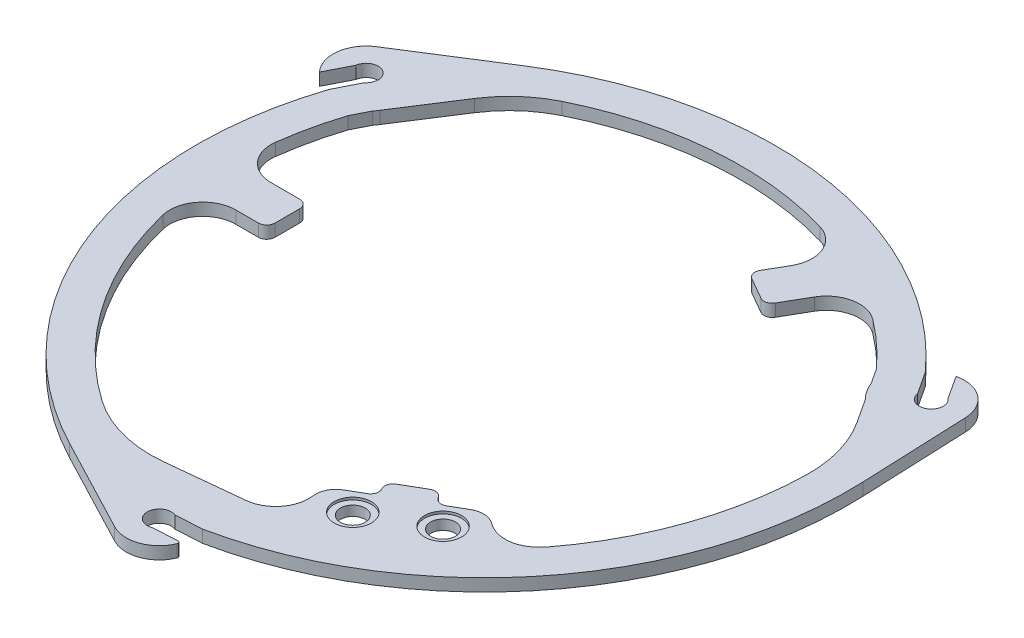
ISO-10303-21;
HEADER;
FILE_DESCRIPTION(('STEP AP214'),'2;1');
FILE_NAME('part.step','',(''),(''),'','','');
FILE_SCHEMA(('AUTOMOTIVE_DESIGN { 1 0 10303 214 1 1 1 1 }'));
ENDSEC;
DATA;
#1=APPLICATION_CONTEXT('core data for automotive mechanical design processes');
#2=APPLICATION_PROTOCOL_DEFINITION('international standard','automotive_design',2000,#1);
#3=PRODUCT_CONTEXT('',#1,'mechanical');
#4=PRODUCT('Part','Part','',(#3));
#5=PRODUCT_RELATED_PRODUCT_CATEGORY('part','',(#4));
#6=PRODUCT_DEFINITION_FORMATION('','',#4);
#7=PRODUCT_DEFINITION_CONTEXT('part definition',#1,'design');
#8=PRODUCT_DEFINITION('design','',#6,#7);
#9=PRODUCT_DEFINITION_SHAPE('','',#8);
#10=(LENGTH_UNIT() NAMED_UNIT(*) SI_UNIT(.MILLI.,.METRE.));
#11=(NAMED_UNIT(*) PLANE_ANGLE_UNIT() SI_UNIT($,.RADIAN.));
#12=(NAMED_UNIT(*) SI_UNIT($,.STERADIAN.) SOLID_ANGLE_UNIT());
#13=UNCERTAINTY_MEASURE_WITH_UNIT(LENGTH_MEASURE(1.E-05),#10,'distance_accuracy_value','');
#14=(GEOMETRIC_REPRESENTATION_CONTEXT(3) GLOBAL_UNCERTAINTY_ASSIGNED_CONTEXT((#13)) GLOBAL_UNIT_ASSIGNED_CONTEXT((#10,
#11,#12)) REPRESENTATION_CONTEXT('',''));
#15=CARTESIAN_POINT('',(0.,0.,0.));
#16=DIRECTION('',(0.,0.,1.));
#17=DIRECTION('',(1.,0.,0.));
#18=AXIS2_PLACEMENT_3D('',#15,#16,#17);
#19=CARTESIAN_POINT('',(7.04244708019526,0.,-1.96631019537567));
#20=DIRECTION('',(0.,1.,0.));
#21=DIRECTION('',(0.,0.,1.));
#22=AXIS2_PLACEMENT_3D('',#19,#20,#21);
#23=CYLINDRICAL_SURFACE('',#22,39.7999999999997);
#24=CARTESIAN_POINT('',(7.04244708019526,0.,-1.96631019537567));
#25=DIRECTION('',(0.,1.,0.));
#26=DIRECTION('',(0.,0.,1.));
#27=AXIS2_PLACEMENT_3D('',#24,#25,#26);
#28=CIRCLE('',#27,39.7999999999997);
#29=CARTESIAN_POINT('',(-31.6285918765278,0.,7.44595552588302));
#30=VERTEX_POINT('',#29);
#31=CARTESIAN_POINT('',(-15.809718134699,0.,30.6192471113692));
#32=VERTEX_POINT('',#31);
#33=EDGE_CURVE('E709',#30,#32,#28,.T.);
#34=ORIENTED_EDGE('',*,*,#33,.F.);
#35=DIRECTION('',(0.,1.,0.));
#36=VECTOR('',#35,1.);
#37=CARTESIAN_POINT('',(-31.6285918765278,0.,7.44595552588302));
#38=LINE('',#37,#36);
#39=CARTESIAN_POINT('',(-31.6285918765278,1.5,7.44595552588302));
#40=VERTEX_POINT('',#39);
#41=EDGE_CURVE('E595',#30,#40,#38,.T.);
#42=ORIENTED_EDGE('',*,*,#41,.T.);
#43=CARTESIAN_POINT('',(7.04244708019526,1.5,-1.96631019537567));
#44=DIRECTION('',(0.,1.,0.));
#45=DIRECTION('',(0.,0.,1.));
#46=AXIS2_PLACEMENT_3D('',#43,#44,#45);
#47=CIRCLE('',#46,39.7999999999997);
#48=CARTESIAN_POINT('',(-15.809718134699,1.5,30.6192471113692));
#49=VERTEX_POINT('',#48);
#50=EDGE_CURVE('E704',#40,#49,#47,.T.);
#51=ORIENTED_EDGE('',*,*,#50,.T.);
#52=DIRECTION('',(0.,1.,0.));
#53=VECTOR('',#52,1.);
#54=CARTESIAN_POINT('',(-15.809718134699,0.,30.6192471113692));
#55=LINE('',#54,#53);
#56=EDGE_CURVE('E540',#49,#32,#55,.F.);
#57=ORIENTED_EDGE('',*,*,#56,.T.);
#58=EDGE_LOOP('',(#34,#42,#51,#57));
#59=FACE_BOUND('',#58,.T.);
#60=ADVANCED_FACE('F39',(#59),#23,.F.);
#61=CARTESIAN_POINT('',(-1.81834895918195,0.,7.08209317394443));
#62=DIRECTION('',(0.,1.,0.));
#63=DIRECTION('',(0.,0.,1.));
#64=AXIS2_PLACEMENT_3D('',#61,#62,#63);
#65=CYLINDRICAL_SURFACE('',#64,39.7999999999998);
#66=CARTESIAN_POINT('',(-1.81834895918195,0.,7.08209317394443));
#67=DIRECTION('',(0.,1.,0.));
#68=DIRECTION('',(0.,0.,1.));
#69=AXIS2_PLACEMENT_3D('',#66,#67,#68);
#70=CIRCLE('',#69,39.7999999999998);
#71=CARTESIAN_POINT('',(9.36590929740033,0.,-31.1141418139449));
#72=VERTEX_POINT('',#71);
#73=CARTESIAN_POINT('',(-19.3895631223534,0.,-28.6291436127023));
#74=VERTEX_POINT('',#73);
#75=EDGE_CURVE('E750',#72,#74,#70,.T.);
#76=ORIENTED_EDGE('',*,*,#75,.F.);
#77=DIRECTION('',(0.,1.,0.));
#78=VECTOR('',#77,1.);
#79=CARTESIAN_POINT('',(9.36590929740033,0.,-31.1141418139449));
#80=LINE('',#79,#78);
#81=CARTESIAN_POINT('',(9.36590929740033,1.5,-31.1141418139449));
#82=VERTEX_POINT('',#81);
#83=EDGE_CURVE('E571',#72,#82,#80,.T.);
#84=ORIENTED_EDGE('',*,*,#83,.T.);
#85=CARTESIAN_POINT('',(-1.81834895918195,1.5,7.08209317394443));
#86=DIRECTION('',(0.,1.,0.));
#87=DIRECTION('',(0.,0.,1.));
#88=AXIS2_PLACEMENT_3D('',#85,#86,#87);
#89=CIRCLE('',#88,39.7999999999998);
#90=CARTESIAN_POINT('',(-19.3895631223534,1.5,-28.6291436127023));
#91=VERTEX_POINT('',#90);
#92=EDGE_CURVE('E807',#82,#91,#89,.T.);
#93=ORIENTED_EDGE('',*,*,#92,.T.);
#94=DIRECTION('',(0.,1.,0.));
#95=VECTOR('',#94,1.);
#96=CARTESIAN_POINT('',(-19.3895631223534,0.,-28.6291436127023));
#97=LINE('',#96,#95);
#98=EDGE_CURVE('E524',#91,#74,#97,.F.);
#99=ORIENTED_EDGE('',*,*,#98,.T.);
#100=EDGE_LOOP('',(#76,#84,#93,#99));
#101=FACE_BOUND('',#100,.T.);
#102=ADVANCED_FACE('F998',(#101),#65,.F.);
#103=CARTESIAN_POINT('',(1.23835099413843E-11,1.5,39.5000000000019));
#104=DIRECTION('',(0.,-1.,0.));
#105=DIRECTION('',(0.,0.,-1.));
#106=AXIS2_PLACEMENT_3D('',#103,#104,#105);
#107=PLANE('',#106);
#108=DIRECTION('',(1.,0.,2.98468273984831E-08));
#109=VECTOR('',#108,1.);
#110=CARTESIAN_POINT('',(-34.000000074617,1.5,2.49999898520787));
#111=LINE('',#110,#109);
#112=CARTESIAN_POINT('',(-27.7420551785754,1.5,2.49999917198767));
#113=VERTEX_POINT('',#112);
#114=CARTESIAN_POINT('',(-25.0000000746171,1.5,2.49999925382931));
#115=VERTEX_POINT('',#114);
#116=EDGE_CURVE('E645',#113,#115,#111,.T.);
#117=ORIENTED_EDGE('',*,*,#116,.T.);
#118=CARTESIAN_POINT('',(-25.0000000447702,1.5,1.49999925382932));
#119=DIRECTION('',(0.,-1.,0.));
#120=DIRECTION('',(0.,0.,-1.));
#121=AXIS2_PLACEMENT_3D('',#118,#119,#120);
#122=CIRCLE('',#121,1.);
#123=CARTESIAN_POINT('',(-24.0000000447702,1.5,1.49999928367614));
#124=VERTEX_POINT('',#123);
#125=EDGE_CURVE('E614',#115,#124,#122,.F.);
#126=ORIENTED_EDGE('',*,*,#125,.T.);
#127=DIRECTION('',(2.98468270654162E-08,0.,-1.));
#128=VECTOR('',#127,1.);
#129=CARTESIAN_POINT('',(-24.0000000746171,1.5,2.49999928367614));
#130=LINE('',#129,#128);
#131=CARTESIAN_POINT('',(-23.9999999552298,1.5,-1.50000071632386));
#132=VERTEX_POINT('',#131);
#133=EDGE_CURVE('E644',#124,#132,#130,.T.);
#134=ORIENTED_EDGE('',*,*,#133,.T.);
#135=CARTESIAN_POINT('',(-24.9999999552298,1.5,-1.50000074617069));
#136=DIRECTION('',(0.,-1.,0.));
#137=DIRECTION('',(0.,0.,-1.));
#138=AXIS2_PLACEMENT_3D('',#135,#136,#137);
#139=CIRCLE('',#138,1.);
#140=CARTESIAN_POINT('',(-24.9999999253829,1.5,-2.50000074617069));
#141=VERTEX_POINT('',#140);
#142=EDGE_CURVE('E612',#132,#141,#139,.F.);
#143=ORIENTED_EDGE('',*,*,#142,.T.);
#144=DIRECTION('',(-1.,0.,-2.98468273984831E-08));
#145=VECTOR('',#144,1.);
#146=CARTESIAN_POINT('',(-23.9999999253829,1.5,-2.50000071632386));
#147=LINE('',#146,#145);
#148=CARTESIAN_POINT('',(-28.4693207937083,1.5,-2.50000084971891));
#149=VERTEX_POINT('',#148);
#150=EDGE_CURVE('E636',#141,#149,#147,.T.);
#151=ORIENTED_EDGE('',*,*,#150,.T.);
#152=CARTESIAN_POINT('',(-28.469320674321,1.5,-6.50000084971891));
#153=DIRECTION('',(0.,-1.,0.));
#154=DIRECTION('',(0.,0.,-1.));
#155=AXIS2_PLACEMENT_3D('',#152,#153,#154);
#156=CIRCLE('',#155,4.);
#157=CARTESIAN_POINT('',(-32.4371159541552,1.5,-7.00655846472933));
#158=VERTEX_POINT('',#157);
#159=EDGE_CURVE('E603',#149,#158,#156,.T.);
#160=ORIENTED_EDGE('',*,*,#159,.T.);
#161=CARTESIAN_POINT('',(-30.8387217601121,1.5,-14.1752023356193));
#162=VERTEX_POINT('',#161);
#163=EDGE_CURVE('E763',#162,#158,#47,.T.);
#164=ORIENTED_EDGE('',*,*,#163,.F.);
#165=DIRECTION('',(-0.451339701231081,0.,0.892352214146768));
#166=VECTOR('',#165,1.);
#167=CARTESIAN_POINT('',(-29.818035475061,1.5,-16.1932203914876));
#168=LINE('',#167,#166);
#169=CARTESIAN_POINT('',(-29.8180354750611,1.5,-16.1932203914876));
#170=VERTEX_POINT('',#169);
#171=EDGE_CURVE('E816',#170,#162,#168,.T.);
#172=ORIENTED_EDGE('',*,*,#171,.F.);
#173=CARTESIAN_POINT('',(-34.2080034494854,1.5,-19.7499999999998));
#174=DIRECTION('',(0.,-1.,0.));
#175=DIRECTION('',(0.,0.,-1.));
#176=AXIS2_PLACEMENT_3D('',#173,#174,#175);
#177=CIRCLE('',#176,5.64999999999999);
#178=CARTESIAN_POINT('',(-29.4573891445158,1.5,-16.691542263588));
#179=VERTEX_POINT('',#178);
#180=EDGE_CURVE('E813',#179,#170,#177,.T.);
#181=ORIENTED_EDGE('',*,*,#180,.F.);
#182=DIRECTION('',(-0.541319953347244,0.,0.840816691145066));
#183=VECTOR('',#182,1.);
#184=CARTESIAN_POINT('',(-23.1174854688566,1.5,-26.5391320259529));
#185=LINE('',#184,#183);
#186=CARTESIAN_POINT('',(-24.9801676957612,1.5,-23.6458813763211));
#187=VERTEX_POINT('',#186);
#188=EDGE_CURVE('E811',#187,#179,#185,.T.);
#189=ORIENTED_EDGE('',*,*,#188,.F.);
#190=CARTESIAN_POINT('',(-13.2087340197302,1.5,-16.0674020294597));
#191=DIRECTION('',(0.,-1.,0.));
#192=DIRECTION('',(0.,0.,-1.));
#193=AXIS2_PLACEMENT_3D('',#190,#191,#192);
#194=CIRCLE('',#193,14.);
#195=EDGE_CURVE('E527',#187,#91,#194,.T.);
#196=ORIENTED_EDGE('',*,*,#195,.T.);
#197=ORIENTED_EDGE('',*,*,#92,.F.);
#198=CARTESIAN_POINT('',(8.2418632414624,1.5,-27.2753242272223));
#199=DIRECTION('',(0.,-1.,0.));
#200=DIRECTION('',(0.,0.,-1.));
#201=AXIS2_PLACEMENT_3D('',#198,#199,#200);
#202=CIRCLE('',#201,4.);
#203=CARTESIAN_POINT('',(11.7059647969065,1.5,-25.2753241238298));
#204=VERTEX_POINT('',#203);
#205=EDGE_CURVE('E581',#82,#204,#202,.T.);
#206=ORIENTED_EDGE('',*,*,#205,.T.);
#207=DIRECTION('',(-0.500000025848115,0.,0.866025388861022));
#208=VECTOR('',#207,1.);
#209=CARTESIAN_POINT('',(14.8349374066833,1.5,-30.694863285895));
#210=LINE('',#209,#208);
#211=CARTESIAN_POINT('',(10.3349371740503,1.5,-22.9006347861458));
#212=VERTEX_POINT('',#211);
#213=EDGE_CURVE('E655',#204,#212,#210,.T.);
#214=ORIENTED_EDGE('',*,*,#213,.T.);
#215=CARTESIAN_POINT('',(11.2009625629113,1.5,-22.4006347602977));
#216=DIRECTION('',(0.,-1.,0.));
#217=DIRECTION('',(0.,0.,-1.));
#218=AXIS2_PLACEMENT_3D('',#215,#216,#217);
#219=CIRCLE('',#218,1.);
#220=CARTESIAN_POINT('',(10.7009625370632,1.5,-21.5346093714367));
#221=VERTEX_POINT('',#220);
#222=EDGE_CURVE('E557',#212,#221,#219,.F.);
#223=ORIENTED_EDGE('',*,*,#222,.T.);
#224=DIRECTION('',(0.866025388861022,0.,0.500000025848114));
#225=VECTOR('',#224,1.);
#226=CARTESIAN_POINT('',(9.8349371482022,1.5,-22.0346093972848));
#227=LINE('',#226,#225);
#228=CARTESIAN_POINT('',(13.2990387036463,1.5,-20.0346092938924));
#229=VERTEX_POINT('',#228);
#230=EDGE_CURVE('E661',#221,#229,#227,.T.);
#231=ORIENTED_EDGE('',*,*,#230,.T.);
#232=CARTESIAN_POINT('',(13.7990387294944,1.5,-20.9006346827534));
#233=DIRECTION('',(0.,-1.,0.));
#234=DIRECTION('',(0.,0.,-1.));
#235=AXIS2_PLACEMENT_3D('',#232,#233,#234);
#236=CIRCLE('',#235,1.);
#237=CARTESIAN_POINT('',(14.6650641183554,1.5,-20.4006346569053));
#238=VERTEX_POINT('',#237);
#239=EDGE_CURVE('E559',#229,#238,#236,.F.);
#240=ORIENTED_EDGE('',*,*,#239,.T.);
#241=DIRECTION('',(0.500000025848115,0.,-0.866025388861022));
#242=VECTOR('',#241,1.);
#243=CARTESIAN_POINT('',(14.1650640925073,1.5,-19.5346092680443));
#244=LINE('',#243,#242);
#245=CARTESIAN_POINT('',(16.3997246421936,1.5,-23.4051546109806));
#246=VERTEX_POINT('',#245);
#247=EDGE_CURVE('E657',#238,#246,#244,.T.);
#248=ORIENTED_EDGE('',*,*,#247,.T.);
#249=CARTESIAN_POINT('',(19.8638261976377,1.5,-21.4051545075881));
#250=DIRECTION('',(0.,-1.,0.));
#251=DIRECTION('',(0.,0.,-1.));
#252=AXIS2_PLACEMENT_3D('',#249,#250,#251);
#253=CIRCLE('',#252,4.);
#254=CARTESIAN_POINT('',(22.2864156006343,1.5,-24.5880872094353));
#255=VERTEX_POINT('',#254);
#256=EDGE_CURVE('E587',#246,#255,#253,.T.);
#257=ORIENTED_EDGE('',*,*,#256,.T.);
#258=CARTESIAN_POINT('',(27.6954462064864,1.5,-19.6195152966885));
#259=VERTEX_POINT('',#258);
#260=EDGE_CURVE('E808',#259,#255,#89,.T.);
#261=ORIENTED_EDGE('',*,*,#260,.F.);
#262=DIRECTION('',(-0.547129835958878,0.,-0.837047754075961));
#263=VECTOR('',#262,1.);
#264=CARTESIAN_POINT('',(28.9327579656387,1.5,-17.7265660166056));
#265=LINE('',#264,#263);
#266=CARTESIAN_POINT('',(28.9327579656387,1.5,-17.7265660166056));
#267=VERTEX_POINT('',#266);
#268=EDGE_CURVE('E804',#267,#259,#265,.T.);
#269=ORIENTED_EDGE('',*,*,#268,.F.);
#270=CARTESIAN_POINT('',(34.2080034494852,1.5,-19.75));
#271=DIRECTION('',(0.,-1.,0.));
#272=DIRECTION('',(0.,0.,-1.));
#273=AXIS2_PLACEMENT_3D('',#270,#271,#272);
#274=CIRCLE('',#273,5.64999999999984);
#275=CARTESIAN_POINT('',(30.237699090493,1.5,-15.7301513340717));
#276=VERTEX_POINT('',#275);
#277=EDGE_CURVE('E801',#276,#267,#274,.T.);
#278=ORIENTED_EDGE('',*,*,#277,.F.);
#279=DIRECTION('',(-0.547129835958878,0.,-0.837047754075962));
#280=VECTOR('',#279,1.);
#281=CARTESIAN_POINT('',(34.3385004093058,1.5,-9.45638173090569));
#282=LINE('',#281,#280);
#283=CARTESIAN_POINT('',(32.1269168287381,1.5,-12.839858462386));
#284=VERTEX_POINT('',#283);
#285=EDGE_CURVE('E799',#284,#276,#282,.T.);
#286=ORIENTED_EDGE('',*,*,#285,.F.);
#287=CARTESIAN_POINT('',(19.5712005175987,1.5,-4.6329109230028));
#288=DIRECTION('',(0.,-1.,0.));
#289=DIRECTION('',(0.,0.,-1.));
#290=AXIS2_PLACEMENT_3D('',#287,#288,#289);
#291=CIRCLE('',#290,15.);
#292=CARTESIAN_POINT('',(34.568356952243,1.5,-4.340851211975));
#293=VERTEX_POINT('',#292);
#294=EDGE_CURVE('E543',#284,#293,#291,.T.);
#295=ORIENTED_EDGE('',*,*,#294,.T.);
#296=CARTESIAN_POINT('',(-5.22409812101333,1.5,-5.11578297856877));
#297=DIRECTION('',(0.,1.,0.));
#298=DIRECTION('',(0.,0.,1.));
#299=AXIS2_PLACEMENT_3D('',#296,#297,#298);
#300=CIRCLE('',#299,39.8);
#301=CARTESIAN_POINT('',(26.4067166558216,1.5,19.0406148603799));
#302=VERTEX_POINT('',#301);
#303=EDGE_CURVE('E796',#302,#293,#300,.T.);
#304=ORIENTED_EDGE('',*,*,#303,.F.);
#305=DIRECTION('',(0.97145483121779,0.,-0.237224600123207));
#306=VECTOR('',#305,1.);
#307=CARTESIAN_POINT('',(26.3235938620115,1.5,19.0609130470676));
#308=LINE('',#307,#306);
#309=CARTESIAN_POINT('',(26.3235938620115,1.5,19.0609130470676));
#310=VERTEX_POINT('',#309);
#311=EDGE_CURVE('E793',#310,#302,#308,.T.);
#312=ORIENTED_EDGE('',*,*,#311,.F.);
#313=CARTESIAN_POINT('',(23.0837669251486,1.5,16.7149545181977));
#314=DIRECTION('',(0.,1.,0.));
#315=DIRECTION('',(0.,0.,1.));
#316=AXIS2_PLACEMENT_3D('',#313,#314,#315);
#317=CIRCLE('',#316,3.99999999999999);
#318=CARTESIAN_POINT('',(20.6461326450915,1.5,19.8863799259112));
#319=VERTEX_POINT('',#318);
#320=EDGE_CURVE('E791',#319,#310,#317,.T.);
#321=ORIENTED_EDGE('',*,*,#320,.F.);
#322=CARTESIAN_POINT('',(19.1226112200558,1.5,21.8685208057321));
#323=DIRECTION('',(0.,-1.,0.));
#324=DIRECTION('',(0.,0.,-1.));
#325=AXIS2_PLACEMENT_3D('',#322,#323,#324);
#326=CIRCLE('',#325,2.5);
#327=CARTESIAN_POINT('',(17.8726112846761,1.5,19.7034572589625));
#328=VERTEX_POINT('',#327);
#329=EDGE_CURVE('E508',#319,#328,#326,.F.);
#330=ORIENTED_EDGE('',*,*,#329,.T.);
#331=DIRECTION('',(0.866025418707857,0.,-0.499999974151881));
#332=VECTOR('',#331,1.);
#333=CARTESIAN_POINT('',(16.0310883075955,1.5,20.766660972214));
#334=LINE('',#333,#332);
#335=CARTESIAN_POINT('',(16.0310883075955,1.5,20.766660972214));
#336=VERTEX_POINT('',#335);
#337=EDGE_CURVE('E788',#336,#328,#334,.T.);
#338=ORIENTED_EDGE('',*,*,#337,.F.);
#339=CARTESIAN_POINT('',(15.5310883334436,1.5,19.9006355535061));
#340=DIRECTION('',(0.,1.,0.));
#341=DIRECTION('',(0.,0.,1.));
#342=AXIS2_PLACEMENT_3D('',#339,#340,#341);
#343=CIRCLE('',#342,1.);
#344=CARTESIAN_POINT('',(14.6650629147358,1.5,20.400635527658));
#345=VERTEX_POINT('',#344);
#346=EDGE_CURVE('E785',#345,#336,#343,.T.);
#347=ORIENTED_EDGE('',*,*,#346,.F.);
#348=CARTESIAN_POINT('',(13.7990374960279,1.5,20.9006355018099));
#349=DIRECTION('',(0.,-1.,0.));
#350=DIRECTION('',(0.,0.,-1.));
#351=AXIS2_PLACEMENT_3D('',#348,#349,#350);
#352=CIRCLE('',#351,1.);
#353=CARTESIAN_POINT('',(13.299037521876,1.5,20.0346100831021));
#354=VERTEX_POINT('',#353);
#355=EDGE_CURVE('E782',#354,#345,#352,.T.);
#356=ORIENTED_EDGE('',*,*,#355,.F.);
#357=DIRECTION('',(0.866025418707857,0.,-0.499999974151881));
#358=VECTOR('',#357,1.);
#359=CARTESIAN_POINT('',(10.7009612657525,1.5,21.5346100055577));
#360=LINE('',#359,#358);
#361=CARTESIAN_POINT('',(10.7009612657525,1.5,21.5346100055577));
#362=VERTEX_POINT('',#361);
#363=EDGE_CURVE('E779',#362,#354,#360,.T.);
#364=ORIENTED_EDGE('',*,*,#363,.F.);
#365=CARTESIAN_POINT('',(11.2009612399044,1.5,22.4006354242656));
#366=DIRECTION('',(0.,-1.,0.));
#367=DIRECTION('',(0.,0.,-1.));
#368=AXIS2_PLACEMENT_3D('',#365,#366,#367);
#369=CIRCLE('',#368,1.00000000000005);
#370=CARTESIAN_POINT('',(10.3349358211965,1.5,22.9006353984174));
#371=VERTEX_POINT('',#370);
#372=EDGE_CURVE('E776',#371,#362,#369,.T.);
#373=ORIENTED_EDGE('',*,*,#372,.F.);
#374=CARTESIAN_POINT('',(9.46891040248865,1.5,23.4006353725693));
#375=DIRECTION('',(0.,1.,0.));
#376=DIRECTION('',(0.,0.,1.));
#377=AXIS2_PLACEMENT_3D('',#374,#375,#376);
#378=CIRCLE('',#377,0.999999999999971);
#379=CARTESIAN_POINT('',(9.96891037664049,1.5,24.2666607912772));
#380=VERTEX_POINT('',#379);
#381=EDGE_CURVE('E773',#380,#371,#378,.T.);
#382=ORIENTED_EDGE('',*,*,#381,.F.);
#383=DIRECTION('',(0.866025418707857,0.,-0.499999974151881));
#384=VECTOR('',#383,1.);
#385=CARTESIAN_POINT('',(6.38903092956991,1.5,26.3335050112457));
#386=LINE('',#385,#384);
#387=CARTESIAN_POINT('',(8.12738896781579,1.5,25.3298635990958));
#388=VERTEX_POINT('',#387);
#389=EDGE_CURVE('E771',#388,#380,#386,.T.);
#390=ORIENTED_EDGE('',*,*,#389,.F.);
#391=CARTESIAN_POINT('',(9.37738890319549,1.5,27.4949271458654));
#392=DIRECTION('',(0.,-1.,0.));
#393=DIRECTION('',(0.,0.,-1.));
#394=AXIS2_PLACEMENT_3D('',#391,#392,#393);
#395=CIRCLE('',#394,2.5);
#396=CARTESIAN_POINT('',(6.89904385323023,1.5,27.8232651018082));
#397=VERTEX_POINT('',#396);
#398=EDGE_CURVE('E506',#388,#397,#395,.F.);
#399=ORIENTED_EDGE('',*,*,#398,.T.);
#400=CARTESIAN_POINT('',(2.9336917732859,1.5,28.3486058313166));
#401=DIRECTION('',(0.,1.,0.));
#402=DIRECTION('',(0.,0.,1.));
#403=AXIS2_PLACEMENT_3D('',#400,#401,#402);
#404=CIRCLE('',#403,3.9999999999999);
#405=CARTESIAN_POINT('',(3.3454379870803,1.5,32.3273575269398));
#406=VERTEX_POINT('',#405);
#407=EDGE_CURVE('E768',#406,#397,#404,.T.);
#408=ORIENTED_EDGE('',*,*,#407,.F.);
#409=DIRECTION('',(0.994687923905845,0.,-0.102936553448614));
#410=VECTOR('',#409,1.);
#411=CARTESIAN_POINT('',(-10.4981433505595,1.5,33.7599782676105));
#412=LINE('',#411,#410);
#413=CARTESIAN_POINT('',(-5.65304475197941,1.5,33.258577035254));
#414=VERTEX_POINT('',#413);
#415=EDGE_CURVE('E766',#414,#406,#412,.T.);
#416=ORIENTED_EDGE('',*,*,#415,.F.);
#417=CARTESIAN_POINT('',(-7.19709305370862,1.5,18.3382581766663));
#418=DIRECTION('',(0.,-1.,0.));
#419=DIRECTION('',(0.,0.,-1.));
#420=AXIS2_PLACEMENT_3D('',#417,#418,#419);
#421=CIRCLE('',#420,15.);
#422=EDGE_CURVE('E547',#414,#49,#421,.T.);
#423=ORIENTED_EDGE('',*,*,#422,.T.);
#424=ORIENTED_EDGE('',*,*,#50,.F.);
#425=CARTESIAN_POINT('',(-27.7420552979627,1.5,6.49999917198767));
#426=DIRECTION('',(0.,-1.,0.));
#427=DIRECTION('',(0.,0.,-1.));
#428=AXIS2_PLACEMENT_3D('',#425,#426,#427);
#429=CIRCLE('',#428,4.);
#430=EDGE_CURVE('E605',#40,#113,#429,.T.);
#431=ORIENTED_EDGE('',*,*,#430,.T.);
#432=EDGE_LOOP('',(#117,#126,#134,#143,#151,#160,#164,#172,#181,#189,#196,#197,#206,#214,#223,
#231,#240,#248,#257,#261,#269,#278,#286,#295,#304,#312,#321,#330,#338,#347,#356,#364,#373,#382,
#390,#399,#408,#416,#423,#424,#431));
#433=FACE_BOUND('',#432,.T.);
#434=CARTESIAN_POINT('',(17.9641009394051,1.5,23.1147372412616));
#435=DIRECTION('',(0.,1.,0.));
#436=DIRECTION('',(0.,0.,1.));
#437=AXIS2_PLACEMENT_3D('',#434,#435,#436);
#438=CIRCLE('',#437,2.25);
#439=CARTESIAN_POINT('',(17.9641009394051,1.5,25.3647372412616));
#440=VERTEX_POINT('',#439);
#441=EDGE_CURVE('E670',#440,#440,#438,.T.);
#442=ORIENTED_EDGE('',*,*,#441,.F.);
#443=EDGE_LOOP('',(#442));
#444=FACE_BOUND('',#443,.T.);
#445=DIRECTION('',(-0.545571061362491,0.,-0.83806456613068));
#446=VECTOR('',#445,1.);
#447=CARTESIAN_POINT('',(35.105015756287,1.5,-20.8892405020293));
#448=LINE('',#447,#446);
#449=CARTESIAN_POINT('',(35.1050157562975,1.5,-20.8892405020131));
#450=VERTEX_POINT('',#449);
#451=CARTESIAN_POINT('',(33.3092703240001,1.5,-23.647727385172));
#452=VERTEX_POINT('',#451);
#453=EDGE_CURVE('E884',#450,#452,#448,.T.);
#454=ORIENTED_EDGE('',*,*,#453,.F.);
#455=CARTESIAN_POINT('',(34.2080034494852,1.5,-19.75));
#456=DIRECTION('',(0.,1.,0.));
#457=DIRECTION('',(0.,0.,1.));
#458=AXIS2_PLACEMENT_3D('',#455,#456,#457);
#459=CIRCLE('',#458,1.44999999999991);
#460=CARTESIAN_POINT('',(32.7757911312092,1.5,-19.5235758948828));
#461=VERTEX_POINT('',#460);
#462=EDGE_CURVE('E696',#461,#450,#459,.T.);
#463=ORIENTED_EDGE('',*,*,#462,.F.);
#464=DIRECTION('',(0.547129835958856,0.,0.837047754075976));
#465=VECTOR('',#464,1.);
#466=CARTESIAN_POINT('',(31.035428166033,1.5,-22.1861375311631));
#467=LINE('',#466,#465);
#468=CARTESIAN_POINT('',(31.035428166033,1.5,-22.1861375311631));
#469=VERTEX_POINT('',#468);
#470=EDGE_CURVE('E436',#469,#461,#467,.T.);
#471=ORIENTED_EDGE('',*,*,#470,.F.);
#472=CARTESIAN_POINT('',(-1.81834895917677,1.5,7.08209317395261));
#473=DIRECTION('',(0.,-1.,0.));
#474=DIRECTION('',(0.,0.,-1.));
#475=AXIS2_PLACEMENT_3D('',#472,#473,#474);
#476=CIRCLE('',#475,44.0000000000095);
#477=CARTESIAN_POINT('',(-25.3651675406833,1.5,-30.0870786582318));
#478=VERTEX_POINT('',#477);
#479=EDGE_CURVE('E880',#478,#469,#476,.T.);
#480=ORIENTED_EDGE('',*,*,#479,.F.);
#481=DIRECTION('',(0.844753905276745,0.,-0.535154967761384));
#482=VECTOR('',#481,1.);
#483=CARTESIAN_POINT('',(-36.3486233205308,1.5,-23.1290156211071));
#484=LINE('',#483,#482);
#485=CARTESIAN_POINT('',(-36.3486233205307,1.5,-23.129015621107));
#486=VERTEX_POINT('',#485);
#487=EDGE_CURVE('E877',#486,#478,#484,.T.);
#488=ORIENTED_EDGE('',*,*,#487,.F.);
#489=CARTESIAN_POINT('',(-34.2080034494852,1.5,-19.75));
#490=DIRECTION('',(0.,-1.,0.));
#491=DIRECTION('',(0.,0.,-1.));
#492=AXIS2_PLACEMENT_3D('',#489,#490,#491);
#493=CIRCLE('',#492,4.00000000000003);
#494=CARTESIAN_POINT('',(-37.1341678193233,1.5,-17.0228105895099));
#495=VERTEX_POINT('',#494);
#496=EDGE_CURVE('E874',#495,#486,#493,.T.);
#497=ORIENTED_EDGE('',*,*,#496,.F.);
#498=DIRECTION('',(-0.452999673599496,0.,0.891510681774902));
#499=VECTOR('',#498,1.);
#500=CARTESIAN_POINT('',(-35.6431208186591,1.5,-19.9572151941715));
#501=LINE('',#500,#499);
#502=CARTESIAN_POINT('',(-35.6431208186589,1.5,-19.9572151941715));
#503=VERTEX_POINT('',#502);
#504=EDGE_CURVE('E871',#503,#495,#501,.T.);
#505=ORIENTED_EDGE('',*,*,#504,.F.);
#506=CARTESIAN_POINT('',(-34.2080034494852,1.5,-19.75));
#507=DIRECTION('',(0.,-1.,0.));
#508=DIRECTION('',(0.,0.,-1.));
#509=AXIS2_PLACEMENT_3D('',#506,#507,#508);
#510=CIRCLE('',#509,1.44999999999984);
#511=CARTESIAN_POINT('',(-33.2958082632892,1.5,-18.6228798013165));
#512=VERTEX_POINT('',#511);
#513=EDGE_CURVE('E701',#503,#512,#510,.T.);
#514=ORIENTED_EDGE('',*,*,#513,.T.);
#515=DIRECTION('',(0.451339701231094,0.,-0.892352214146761));
#516=VECTOR('',#515,1.);
#517=CARTESIAN_POINT('',(-34.7314727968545,1.5,-15.7844004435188));
#518=LINE('',#517,#516);
#519=CARTESIAN_POINT('',(-34.7314727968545,1.5,-15.7844004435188));
#520=VERTEX_POINT('',#519);
#521=EDGE_CURVE('E868',#520,#512,#518,.T.);
#522=ORIENTED_EDGE('',*,*,#521,.F.);
#523=CARTESIAN_POINT('',(7.04244708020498,1.5,-1.96631019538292));
#524=DIRECTION('',(0.,-1.,0.));
#525=DIRECTION('',(0.,0.,-1.));
#526=AXIS2_PLACEMENT_3D('',#523,#524,#525);
#527=CIRCLE('',#526,44.0000000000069);
#528=CARTESIAN_POINT('',(-13.373590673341,1.5,37.0104187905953));
#529=VERTEX_POINT('',#528);
#530=EDGE_CURVE('E865',#529,#520,#527,.T.);
#531=ORIENTED_EDGE('',*,*,#530,.F.);
#532=DIRECTION('',(-0.885834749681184,0.,-0.464000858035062));
#533=VECTOR('',#532,1.);
#534=CARTESIAN_POINT('',(-1.85600343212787,1.5,43.0433389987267));
#535=LINE('',#534,#533);
#536=CARTESIAN_POINT('',(-1.85600343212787,1.5,43.0433389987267));
#537=VERTEX_POINT('',#536);
#538=EDGE_CURVE('E862',#537,#529,#535,.T.);
#539=ORIENTED_EDGE('',*,*,#538,.F.);
#540=CARTESIAN_POINT('',(1.23835099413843E-11,1.5,39.5000000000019));
#541=DIRECTION('',(0.,-1.,0.));
#542=DIRECTION('',(0.,0.,-1.));
#543=AXIS2_PLACEMENT_3D('',#540,#541,#542);
#544=CIRCLE('',#543,4.00000000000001);
#545=CARTESIAN_POINT('',(3.69319972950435,1.5,41.0363188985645));
#546=VERTEX_POINT('',#545);
#547=EDGE_CURVE('E859',#546,#537,#544,.T.);
#548=ORIENTED_EDGE('',*,*,#547,.F.);
#549=CARTESIAN_POINT('',(3.46237474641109,1.5,40.9402989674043));
#550=DIRECTION('',(0.,-1.,0.));
#551=DIRECTION('',(0.,0.,-1.));
#552=AXIS2_PLACEMENT_3D('',#549,#550,#551);
#553=CIRCLE('',#552,0.250000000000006);
#554=CARTESIAN_POINT('',(3.44901321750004,1.5,40.6906562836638));
#555=VERTEX_POINT('',#554);
#556=EDGE_CURVE('E856',#555,#546,#553,.T.);
#557=ORIENTED_EDGE('',*,*,#556,.F.);
#558=DIRECTION('',(0.998570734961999,0.,-0.0534461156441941));
#559=VECTOR('',#558,1.);
#560=CARTESIAN_POINT('',(0.538105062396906,1.5,40.8464556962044));
#561=LINE('',#560,#559);
#562=CARTESIAN_POINT('',(0.538105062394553,1.5,40.8464556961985));
#563=VERTEX_POINT('',#562);
#564=EDGE_CURVE('E463',#563,#555,#561,.T.);
#565=ORIENTED_EDGE('',*,*,#564,.F.);
#566=CARTESIAN_POINT('',(0.,1.5,39.5));
#567=DIRECTION('',(0.,-1.,0.));
#568=DIRECTION('',(0.,0.,-1.));
#569=AXIS2_PLACEMENT_3D('',#566,#567,#568);
#570=CIRCLE('',#569,1.45);
#571=CARTESIAN_POINT('',(0.520017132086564,1.5,38.1464556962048));
#572=VERTEX_POINT('',#571);
#573=EDGE_CURVE('E698',#563,#572,#570,.T.);
#574=ORIENTED_EDGE('',*,*,#573,.T.);
#575=DIRECTION('',(-0.998469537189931,0.,0.0553044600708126));
#576=VECTOR('',#575,1.);
#577=CARTESIAN_POINT('',(3.69604463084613,1.5,37.9705379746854));
#578=LINE('',#577,#576);
#579=CARTESIAN_POINT('',(3.69604463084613,1.5,37.9705379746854));
#580=VERTEX_POINT('',#579);
#581=EDGE_CURVE('E501',#580,#572,#578,.T.);
#582=ORIENTED_EDGE('',*,*,#581,.F.);
#583=CARTESIAN_POINT('',(-5.22409812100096,1.5,-5.1157829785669));
#584=DIRECTION('',(0.,-1.,0.));
#585=DIRECTION('',(0.,0.,-1.));
#586=AXIS2_PLACEMENT_3D('',#583,#584,#585);
#587=CIRCLE('',#586,44.);
#588=CARTESIAN_POINT('',(38.7387582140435,1.5,-6.92334013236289));
#589=VERTEX_POINT('',#588);
#590=EDGE_CURVE('E893',#589,#580,#587,.T.);
#591=ORIENTED_EDGE('',*,*,#590,.F.);
#592=DIRECTION('',(0.0410808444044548,0.,0.999155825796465));
#593=VECTOR('',#592,1.);
#594=CARTESIAN_POINT('',(38.2046267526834,1.5,-19.9143233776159));
#595=LINE('',#594,#593);
#596=CARTESIAN_POINT('',(38.2046267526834,1.5,-19.9143233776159));
#597=VERTEX_POINT('',#596);
#598=EDGE_CURVE('E890',#597,#589,#595,.T.);
#599=ORIENTED_EDGE('',*,*,#598,.F.);
#600=CARTESIAN_POINT('',(34.2080034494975,1.5,-19.7499999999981));
#601=DIRECTION('',(0.,-1.,0.));
#602=DIRECTION('',(0.,0.,-1.));
#603=AXIS2_PLACEMENT_3D('',#600,#601,#602);
#604=CIRCLE('',#603,4.00000000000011);
#605=EDGE_CURVE('E887',#452,#597,#604,.T.);
#606=ORIENTED_EDGE('',*,*,#605,.F.);
#607=EDGE_LOOP('',(#454,#463,#471,#480,#488,#497,#505,#514,#522,#531,#539,#548,#557,#565,#574,
#582,#591,#599,#606));
#608=FACE_BOUND('',#607,.T.);
#609=CARTESIAN_POINT('',(11.0358975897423,1.5,27.1147370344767));
#610=DIRECTION('',(0.,1.,0.));
#611=DIRECTION('',(0.,0.,1.));
#612=AXIS2_PLACEMENT_3D('',#609,#610,#611);
#613=CIRCLE('',#612,2.25);
#614=CARTESIAN_POINT('',(11.0358975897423,1.5,29.3647370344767));
#615=VERTEX_POINT('',#614);
#616=EDGE_CURVE('E684',#615,#615,#613,.T.);
#617=ORIENTED_EDGE('',*,*,#616,.F.);
#618=EDGE_LOOP('',(#617));
#619=FACE_BOUND('',#618,.T.);
#620=ADVANCED_FACE('F642',(#433,#444,#608,#619),#107,.F.);
#621=CARTESIAN_POINT('',(1.23835099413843E-11,0.,39.5000000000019));
#622=DIRECTION('',(0.,-1.,0.));
#623=DIRECTION('',(0.,0.,-1.));
#624=AXIS2_PLACEMENT_3D('',#621,#622,#623);
#625=PLANE('',#624);
#626=DIRECTION('',(2.98468270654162E-08,0.,-1.));
#627=VECTOR('',#626,1.);
#628=CARTESIAN_POINT('',(-24.0000000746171,0.,2.49999928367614));
#629=LINE('',#628,#627);
#630=CARTESIAN_POINT('',(-24.0000000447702,0.,1.49999928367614));
#631=VERTEX_POINT('',#630);
#632=CARTESIAN_POINT('',(-23.9999999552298,0.,-1.50000071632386));
#633=VERTEX_POINT('',#632);
#634=EDGE_CURVE('E627',#631,#633,#629,.T.);
#635=ORIENTED_EDGE('',*,*,#634,.F.);
#636=CARTESIAN_POINT('',(-25.0000000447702,0.,1.49999925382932));
#637=DIRECTION('',(0.,-1.,0.));
#638=DIRECTION('',(0.,0.,-1.));
#639=AXIS2_PLACEMENT_3D('',#636,#637,#638);
#640=CIRCLE('',#639,1.);
#641=CARTESIAN_POINT('',(-25.0000000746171,0.,2.49999925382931));
#642=VERTEX_POINT('',#641);
#643=EDGE_CURVE('E47',#631,#642,#640,.T.);
#644=ORIENTED_EDGE('',*,*,#643,.T.);
#645=DIRECTION('',(1.,0.,2.98468273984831E-08));
#646=VECTOR('',#645,1.);
#647=CARTESIAN_POINT('',(-34.000000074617,0.,2.49999898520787));
#648=LINE('',#647,#646);
#649=CARTESIAN_POINT('',(-27.7420551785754,0.,2.49999917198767));
#650=VERTEX_POINT('',#649);
#651=EDGE_CURVE('E625',#650,#642,#648,.T.);
#652=ORIENTED_EDGE('',*,*,#651,.F.);
#653=CARTESIAN_POINT('',(-27.7420552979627,0.,6.49999917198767));
#654=DIRECTION('',(0.,-1.,0.));
#655=DIRECTION('',(0.,0.,-1.));
#656=AXIS2_PLACEMENT_3D('',#653,#654,#655);
#657=CIRCLE('',#656,4.);
#658=EDGE_CURVE('E607',#650,#30,#657,.F.);
#659=ORIENTED_EDGE('',*,*,#658,.T.);
#660=ORIENTED_EDGE('',*,*,#33,.T.);
#661=CARTESIAN_POINT('',(-7.19709305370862,0.,18.3382581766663));
#662=DIRECTION('',(0.,-1.,0.));
#663=DIRECTION('',(0.,0.,-1.));
#664=AXIS2_PLACEMENT_3D('',#661,#662,#663);
#665=CIRCLE('',#664,15.);
#666=CARTESIAN_POINT('',(-5.65304475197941,0.,33.258577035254));
#667=VERTEX_POINT('',#666);
#668=EDGE_CURVE('E550',#32,#667,#665,.F.);
#669=ORIENTED_EDGE('',*,*,#668,.T.);
#670=DIRECTION('',(0.994687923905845,0.,-0.102936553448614));
#671=VECTOR('',#670,1.);
#672=CARTESIAN_POINT('',(-10.4981433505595,0.,33.7599782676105));
#673=LINE('',#672,#671);
#674=CARTESIAN_POINT('',(3.3454379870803,0.,32.3273575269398));
#675=VERTEX_POINT('',#674);
#676=EDGE_CURVE('E708',#667,#675,#673,.T.);
#677=ORIENTED_EDGE('',*,*,#676,.T.);
#678=CARTESIAN_POINT('',(2.9336917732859,0.,28.3486058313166));
#679=DIRECTION('',(0.,1.,0.));
#680=DIRECTION('',(0.,0.,1.));
#681=AXIS2_PLACEMENT_3D('',#678,#679,#680);
#682=CIRCLE('',#681,3.9999999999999);
#683=CARTESIAN_POINT('',(6.89904385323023,0.,27.8232651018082));
#684=VERTEX_POINT('',#683);
#685=EDGE_CURVE('E711',#675,#684,#682,.T.);
#686=ORIENTED_EDGE('',*,*,#685,.T.);
#687=CARTESIAN_POINT('',(9.37738890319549,0.,27.4949271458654));
#688=DIRECTION('',(0.,-1.,0.));
#689=DIRECTION('',(0.,0.,-1.));
#690=AXIS2_PLACEMENT_3D('',#687,#688,#689);
#691=CIRCLE('',#690,2.5);
#692=CARTESIAN_POINT('',(8.12738896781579,0.,25.3298635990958));
#693=VERTEX_POINT('',#692);
#694=EDGE_CURVE('E512',#684,#693,#691,.T.);
#695=ORIENTED_EDGE('',*,*,#694,.T.);
#696=DIRECTION('',(0.866025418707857,0.,-0.499999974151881));
#697=VECTOR('',#696,1.);
#698=CARTESIAN_POINT('',(6.38903092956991,0.,26.3335050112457));
#699=LINE('',#698,#697);
#700=CARTESIAN_POINT('',(9.96891037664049,0.,24.2666607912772));
#701=VERTEX_POINT('',#700);
#702=EDGE_CURVE('E714',#693,#701,#699,.T.);
#703=ORIENTED_EDGE('',*,*,#702,.T.);
#704=CARTESIAN_POINT('',(9.46891040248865,0.,23.4006353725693));
#705=DIRECTION('',(0.,1.,0.));
#706=DIRECTION('',(0.,0.,1.));
#707=AXIS2_PLACEMENT_3D('',#704,#705,#706);
#708=CIRCLE('',#707,0.999999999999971);
#709=CARTESIAN_POINT('',(10.3349358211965,0.,22.9006353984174));
#710=VERTEX_POINT('',#709);
#711=EDGE_CURVE('E716',#701,#710,#708,.T.);
#712=ORIENTED_EDGE('',*,*,#711,.T.);
#713=CARTESIAN_POINT('',(11.2009612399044,0.,22.4006354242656));
#714=DIRECTION('',(0.,-1.,0.));
#715=DIRECTION('',(0.,0.,-1.));
#716=AXIS2_PLACEMENT_3D('',#713,#714,#715);
#717=CIRCLE('',#716,1.00000000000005);
#718=CARTESIAN_POINT('',(10.7009612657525,0.,21.5346100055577));
#719=VERTEX_POINT('',#718);
#720=EDGE_CURVE('E719',#710,#719,#717,.T.);
#721=ORIENTED_EDGE('',*,*,#720,.T.);
#722=DIRECTION('',(0.866025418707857,0.,-0.499999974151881));
#723=VECTOR('',#722,1.);
#724=CARTESIAN_POINT('',(10.7009612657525,0.,21.5346100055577));
#725=LINE('',#724,#723);
#726=CARTESIAN_POINT('',(13.299037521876,0.,20.0346100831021));
#727=VERTEX_POINT('',#726);
#728=EDGE_CURVE('E722',#719,#727,#725,.T.);
#729=ORIENTED_EDGE('',*,*,#728,.T.);
#730=CARTESIAN_POINT('',(13.7990374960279,0.,20.9006355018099));
#731=DIRECTION('',(0.,-1.,0.));
#732=DIRECTION('',(0.,0.,-1.));
#733=AXIS2_PLACEMENT_3D('',#730,#731,#732);
#734=CIRCLE('',#733,1.);
#735=CARTESIAN_POINT('',(14.6650629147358,0.,20.400635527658));
#736=VERTEX_POINT('',#735);
#737=EDGE_CURVE('E725',#727,#736,#734,.T.);
#738=ORIENTED_EDGE('',*,*,#737,.T.);
#739=CARTESIAN_POINT('',(15.5310883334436,0.,19.9006355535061));
#740=DIRECTION('',(0.,1.,0.));
#741=DIRECTION('',(0.,0.,1.));
#742=AXIS2_PLACEMENT_3D('',#739,#740,#741);
#743=CIRCLE('',#742,1.);
#744=CARTESIAN_POINT('',(16.0310883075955,0.,20.766660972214));
#745=VERTEX_POINT('',#744);
#746=EDGE_CURVE('E728',#736,#745,#743,.T.);
#747=ORIENTED_EDGE('',*,*,#746,.T.);
#748=DIRECTION('',(0.866025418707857,0.,-0.499999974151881));
#749=VECTOR('',#748,1.);
#750=CARTESIAN_POINT('',(16.0310883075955,0.,20.766660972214));
#751=LINE('',#750,#749);
#752=CARTESIAN_POINT('',(17.8726112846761,0.,19.7034572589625));
#753=VERTEX_POINT('',#752);
#754=EDGE_CURVE('E731',#745,#753,#751,.T.);
#755=ORIENTED_EDGE('',*,*,#754,.T.);
#756=CARTESIAN_POINT('',(19.1226112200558,0.,21.8685208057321));
#757=DIRECTION('',(0.,-1.,0.));
#758=DIRECTION('',(0.,0.,-1.));
#759=AXIS2_PLACEMENT_3D('',#756,#757,#758);
#760=CIRCLE('',#759,2.5);
#761=CARTESIAN_POINT('',(20.6461326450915,0.,19.8863799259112));
#762=VERTEX_POINT('',#761);
#763=EDGE_CURVE('E514',#753,#762,#760,.T.);
#764=ORIENTED_EDGE('',*,*,#763,.T.);
#765=CARTESIAN_POINT('',(23.0837669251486,0.,16.7149545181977));
#766=DIRECTION('',(0.,1.,0.));
#767=DIRECTION('',(0.,0.,1.));
#768=AXIS2_PLACEMENT_3D('',#765,#766,#767);
#769=CIRCLE('',#768,3.99999999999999);
#770=CARTESIAN_POINT('',(26.3235938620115,0.,19.0609130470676));
#771=VERTEX_POINT('',#770);
#772=EDGE_CURVE('E734',#762,#771,#769,.T.);
#773=ORIENTED_EDGE('',*,*,#772,.T.);
#774=DIRECTION('',(0.97145483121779,0.,-0.237224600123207));
#775=VECTOR('',#774,1.);
#776=CARTESIAN_POINT('',(26.3235938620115,0.,19.0609130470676));
#777=LINE('',#776,#775);
#778=CARTESIAN_POINT('',(26.4067166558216,0.,19.0406148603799));
#779=VERTEX_POINT('',#778);
#780=EDGE_CURVE('E736',#771,#779,#777,.T.);
#781=ORIENTED_EDGE('',*,*,#780,.T.);
#782=CARTESIAN_POINT('',(-5.22409812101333,0.,-5.11578297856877));
#783=DIRECTION('',(0.,1.,0.));
#784=DIRECTION('',(0.,0.,1.));
#785=AXIS2_PLACEMENT_3D('',#782,#783,#784);
#786=CIRCLE('',#785,39.8);
#787=CARTESIAN_POINT('',(34.568356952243,0.,-4.340851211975));
#788=VERTEX_POINT('',#787);
#789=EDGE_CURVE('E739',#779,#788,#786,.T.);
#790=ORIENTED_EDGE('',*,*,#789,.T.);
#791=CARTESIAN_POINT('',(19.5712005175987,0.,-4.6329109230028));
#792=DIRECTION('',(0.,-1.,0.));
#793=DIRECTION('',(0.,0.,-1.));
#794=AXIS2_PLACEMENT_3D('',#791,#792,#793);
#795=CIRCLE('',#794,15.);
#796=CARTESIAN_POINT('',(32.1269168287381,0.,-12.839858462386));
#797=VERTEX_POINT('',#796);
#798=EDGE_CURVE('E545',#788,#797,#795,.F.);
#799=ORIENTED_EDGE('',*,*,#798,.T.);
#800=DIRECTION('',(-0.547129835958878,0.,-0.837047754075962));
#801=VECTOR('',#800,1.);
#802=CARTESIAN_POINT('',(34.3385004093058,0.,-9.45638173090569));
#803=LINE('',#802,#801);
#804=CARTESIAN_POINT('',(30.237699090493,0.,-15.7301513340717));
#805=VERTEX_POINT('',#804);
#806=EDGE_CURVE('E742',#797,#805,#803,.T.);
#807=ORIENTED_EDGE('',*,*,#806,.T.);
#808=CARTESIAN_POINT('',(34.2080034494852,0.,-19.75));
#809=DIRECTION('',(0.,-1.,0.));
#810=DIRECTION('',(0.,0.,-1.));
#811=AXIS2_PLACEMENT_3D('',#808,#809,#810);
#812=CIRCLE('',#811,5.64999999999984);
#813=CARTESIAN_POINT('',(28.9327579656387,0.,-17.7265660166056));
#814=VERTEX_POINT('',#813);
#815=EDGE_CURVE('E744',#805,#814,#812,.T.);
#816=ORIENTED_EDGE('',*,*,#815,.T.);
#817=DIRECTION('',(-0.547129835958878,0.,-0.837047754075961));
#818=VECTOR('',#817,1.);
#819=CARTESIAN_POINT('',(28.9327579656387,0.,-17.7265660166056));
#820=LINE('',#819,#818);
#821=CARTESIAN_POINT('',(27.6954462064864,0.,-19.6195152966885));
#822=VERTEX_POINT('',#821);
#823=EDGE_CURVE('E747',#814,#822,#820,.T.);
#824=ORIENTED_EDGE('',*,*,#823,.T.);
#825=CARTESIAN_POINT('',(22.2864156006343,0.,-24.5880872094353));
#826=VERTEX_POINT('',#825);
#827=EDGE_CURVE('E751',#822,#826,#70,.T.);
#828=ORIENTED_EDGE('',*,*,#827,.T.);
#829=CARTESIAN_POINT('',(19.8638261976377,0.,-21.4051545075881));
#830=DIRECTION('',(0.,-1.,0.));
#831=DIRECTION('',(0.,0.,-1.));
#832=AXIS2_PLACEMENT_3D('',#829,#830,#831);
#833=CIRCLE('',#832,4.);
#834=CARTESIAN_POINT('',(16.3997246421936,0.,-23.4051546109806));
#835=VERTEX_POINT('',#834);
#836=EDGE_CURVE('E585',#826,#835,#833,.F.);
#837=ORIENTED_EDGE('',*,*,#836,.T.);
#838=DIRECTION('',(0.500000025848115,0.,-0.866025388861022));
#839=VECTOR('',#838,1.);
#840=CARTESIAN_POINT('',(14.1650640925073,0.,-19.5346092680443));
#841=LINE('',#840,#839);
#842=CARTESIAN_POINT('',(14.6650641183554,0.,-20.4006346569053));
#843=VERTEX_POINT('',#842);
#844=EDGE_CURVE('E667',#843,#835,#841,.T.);
#845=ORIENTED_EDGE('',*,*,#844,.F.);
#846=CARTESIAN_POINT('',(13.7990387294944,0.,-20.9006346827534));
#847=DIRECTION('',(0.,-1.,0.));
#848=DIRECTION('',(0.,0.,-1.));
#849=AXIS2_PLACEMENT_3D('',#846,#847,#848);
#850=CIRCLE('',#849,1.);
#851=CARTESIAN_POINT('',(13.2990387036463,0.,-20.0346092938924));
#852=VERTEX_POINT('',#851);
#853=EDGE_CURVE('E566',#843,#852,#850,.T.);
#854=ORIENTED_EDGE('',*,*,#853,.T.);
#855=DIRECTION('',(0.866025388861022,0.,0.500000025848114));
#856=VECTOR('',#855,1.);
#857=CARTESIAN_POINT('',(9.8349371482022,0.,-22.0346093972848));
#858=LINE('',#857,#856);
#859=CARTESIAN_POINT('',(10.7009625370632,0.,-21.5346093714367));
#860=VERTEX_POINT('',#859);
#861=EDGE_CURVE('E666',#860,#852,#858,.T.);
#862=ORIENTED_EDGE('',*,*,#861,.F.);
#863=CARTESIAN_POINT('',(11.2009625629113,0.,-22.4006347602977));
#864=DIRECTION('',(0.,-1.,0.));
#865=DIRECTION('',(0.,0.,-1.));
#866=AXIS2_PLACEMENT_3D('',#863,#864,#865);
#867=CIRCLE('',#866,1.);
#868=CARTESIAN_POINT('',(10.3349371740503,0.,-22.9006347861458));
#869=VERTEX_POINT('',#868);
#870=EDGE_CURVE('E563',#860,#869,#867,.T.);
#871=ORIENTED_EDGE('',*,*,#870,.T.);
#872=DIRECTION('',(-0.500000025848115,0.,0.866025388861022));
#873=VECTOR('',#872,1.);
#874=CARTESIAN_POINT('',(14.8349374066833,0.,-30.694863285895));
#875=LINE('',#874,#873);
#876=CARTESIAN_POINT('',(11.7059647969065,0.,-25.2753241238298));
#877=VERTEX_POINT('',#876);
#878=EDGE_CURVE('E660',#877,#869,#875,.T.);
#879=ORIENTED_EDGE('',*,*,#878,.F.);
#880=CARTESIAN_POINT('',(8.2418632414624,0.,-27.2753242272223));
#881=DIRECTION('',(0.,-1.,0.));
#882=DIRECTION('',(0.,0.,-1.));
#883=AXIS2_PLACEMENT_3D('',#880,#881,#882);
#884=CIRCLE('',#883,4.);
#885=EDGE_CURVE('E583',#877,#72,#884,.F.);
#886=ORIENTED_EDGE('',*,*,#885,.T.);
#887=ORIENTED_EDGE('',*,*,#75,.T.);
#888=CARTESIAN_POINT('',(-13.2087340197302,0.,-16.0674020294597));
#889=DIRECTION('',(0.,-1.,0.));
#890=DIRECTION('',(0.,0.,-1.));
#891=AXIS2_PLACEMENT_3D('',#888,#889,#890);
#892=CIRCLE('',#891,14.);
#893=CARTESIAN_POINT('',(-24.9801676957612,0.,-23.6458813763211));
#894=VERTEX_POINT('',#893);
#895=EDGE_CURVE('E530',#74,#894,#892,.F.);
#896=ORIENTED_EDGE('',*,*,#895,.T.);
#897=DIRECTION('',(-0.541319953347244,0.,0.840816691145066));
#898=VECTOR('',#897,1.);
#899=CARTESIAN_POINT('',(-23.1174854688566,0.,-26.5391320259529));
#900=LINE('',#899,#898);
#901=CARTESIAN_POINT('',(-29.4573891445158,0.,-16.691542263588));
#902=VERTEX_POINT('',#901);
#903=EDGE_CURVE('E754',#894,#902,#900,.T.);
#904=ORIENTED_EDGE('',*,*,#903,.T.);
#905=CARTESIAN_POINT('',(-34.2080034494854,0.,-19.7499999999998));
#906=DIRECTION('',(0.,-1.,0.));
#907=DIRECTION('',(0.,0.,-1.));
#908=AXIS2_PLACEMENT_3D('',#905,#906,#907);
#909=CIRCLE('',#908,5.64999999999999);
#910=CARTESIAN_POINT('',(-29.8180354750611,0.,-16.1932203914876));
#911=VERTEX_POINT('',#910);
#912=EDGE_CURVE('E756',#902,#911,#909,.T.);
#913=ORIENTED_EDGE('',*,*,#912,.T.);
#914=DIRECTION('',(-0.451339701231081,0.,0.892352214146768));
#915=VECTOR('',#914,1.);
#916=CARTESIAN_POINT('',(-29.818035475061,0.,-16.1932203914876));
#917=LINE('',#916,#915);
#918=CARTESIAN_POINT('',(-30.8387217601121,0.,-14.1752023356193));
#919=VERTEX_POINT('',#918);
#920=EDGE_CURVE('E759',#911,#919,#917,.T.);
#921=ORIENTED_EDGE('',*,*,#920,.T.);
#922=CARTESIAN_POINT('',(-32.4371159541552,0.,-7.00655846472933));
#923=VERTEX_POINT('',#922);
#924=EDGE_CURVE('E705',#919,#923,#28,.T.);
#925=ORIENTED_EDGE('',*,*,#924,.T.);
#926=CARTESIAN_POINT('',(-28.469320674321,0.,-6.50000084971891));
#927=DIRECTION('',(0.,-1.,0.));
#928=DIRECTION('',(0.,0.,-1.));
#929=AXIS2_PLACEMENT_3D('',#926,#927,#928);
#930=CIRCLE('',#929,4.);
#931=CARTESIAN_POINT('',(-28.4693207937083,0.,-2.50000084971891));
#932=VERTEX_POINT('',#931);
#933=EDGE_CURVE('E600',#923,#932,#930,.F.);
#934=ORIENTED_EDGE('',*,*,#933,.T.);
#935=DIRECTION('',(-1.,0.,-2.98468273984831E-08));
#936=VECTOR('',#935,1.);
#937=CARTESIAN_POINT('',(-23.9999999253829,0.,-2.50000071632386));
#938=LINE('',#937,#936);
#939=CARTESIAN_POINT('',(-24.9999999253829,0.,-2.50000074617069));
#940=VERTEX_POINT('',#939);
#941=EDGE_CURVE('E653',#940,#932,#938,.T.);
#942=ORIENTED_EDGE('',*,*,#941,.F.);
#943=CARTESIAN_POINT('',(-24.9999999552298,0.,-1.50000074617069));
#944=DIRECTION('',(0.,-1.,0.));
#945=DIRECTION('',(0.,0.,-1.));
#946=AXIS2_PLACEMENT_3D('',#943,#944,#945);
#947=CIRCLE('',#946,1.);
#948=EDGE_CURVE('E59',#940,#633,#947,.T.);
#949=ORIENTED_EDGE('',*,*,#948,.T.);
#950=EDGE_LOOP('',(#635,#644,#652,#659,#660,#669,#677,#686,#695,#703,#712,#721,#729,#738,#747,
#755,#764,#773,#781,#790,#799,#807,#816,#824,#828,#837,#845,#854,#862,#871,#879,#886,#887,#896,
#904,#913,#921,#925,#934,#942,#949));
#951=FACE_BOUND('',#950,.T.);
#952=CARTESIAN_POINT('',(17.9641009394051,0.,23.1147372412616));
#953=DIRECTION('',(0.,1.,0.));
#954=DIRECTION('',(0.,0.,1.));
#955=AXIS2_PLACEMENT_3D('',#952,#953,#954);
#956=CIRCLE('',#955,1.5);
#957=CARTESIAN_POINT('',(17.9641009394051,0.,24.6147372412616));
#958=VERTEX_POINT('',#957);
#959=EDGE_CURVE('E681',#958,#958,#956,.T.);
#960=ORIENTED_EDGE('',*,*,#959,.T.);
#961=EDGE_LOOP('',(#960));
#962=FACE_BOUND('',#961,.T.);
#963=CARTESIAN_POINT('',(34.2080034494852,0.,-19.75));
#964=DIRECTION('',(0.,-1.,0.));
#965=DIRECTION('',(0.,0.,-1.));
#966=AXIS2_PLACEMENT_3D('',#963,#964,#965);
#967=CIRCLE('',#966,1.44999999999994);
#968=CARTESIAN_POINT('',(35.105015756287,0.,-20.8892405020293));
#969=VERTEX_POINT('',#968);
#970=CARTESIAN_POINT('',(32.775791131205,0.,-19.5235758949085));
#971=VERTEX_POINT('',#970);
#972=EDGE_CURVE('E415',#969,#971,#967,.T.);
#973=ORIENTED_EDGE('',*,*,#972,.F.);
#974=DIRECTION('',(-0.545571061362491,0.,-0.83806456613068));
#975=VECTOR('',#974,1.);
#976=CARTESIAN_POINT('',(35.105015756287,0.,-20.8892405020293));
#977=LINE('',#976,#975);
#978=CARTESIAN_POINT('',(33.3092703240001,0.,-23.647727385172));
#979=VERTEX_POINT('',#978);
#980=EDGE_CURVE('E444',#969,#979,#977,.T.);
#981=ORIENTED_EDGE('',*,*,#980,.T.);
#982=CARTESIAN_POINT('',(34.2080034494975,0.,-19.7499999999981));
#983=DIRECTION('',(0.,-1.,0.));
#984=DIRECTION('',(0.,0.,-1.));
#985=AXIS2_PLACEMENT_3D('',#982,#983,#984);
#986=CIRCLE('',#985,4.00000000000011);
#987=CARTESIAN_POINT('',(38.2046267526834,0.,-19.9143233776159));
#988=VERTEX_POINT('',#987);
#989=EDGE_CURVE('E446',#979,#988,#986,.T.);
#990=ORIENTED_EDGE('',*,*,#989,.T.);
#991=DIRECTION('',(0.0410808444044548,0.,0.999155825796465));
#992=VECTOR('',#991,1.);
#993=CARTESIAN_POINT('',(38.2046267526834,0.,-19.9143233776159));
#994=LINE('',#993,#992);
#995=CARTESIAN_POINT('',(38.7387582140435,0.,-6.92334013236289));
#996=VERTEX_POINT('',#995);
#997=EDGE_CURVE('E454',#988,#996,#994,.T.);
#998=ORIENTED_EDGE('',*,*,#997,.T.);
#999=CARTESIAN_POINT('',(-5.22409812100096,0.,-5.1157829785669));
#1000=DIRECTION('',(0.,-1.,0.));
#1001=DIRECTION('',(0.,0.,-1.));
#1002=AXIS2_PLACEMENT_3D('',#999,#1000,#1001);
#1003=CIRCLE('',#1002,44.);
#1004=CARTESIAN_POINT('',(3.69604463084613,0.,37.9705379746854));
#1005=VERTEX_POINT('',#1004);
#1006=EDGE_CURVE('E457',#996,#1005,#1003,.T.);
#1007=ORIENTED_EDGE('',*,*,#1006,.T.);
#1008=DIRECTION('',(-0.998469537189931,0.,0.0553044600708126));
#1009=VECTOR('',#1008,1.);
#1010=CARTESIAN_POINT('',(3.69604463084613,0.,37.9705379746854));
#1011=LINE('',#1010,#1009);
#1012=CARTESIAN_POINT('',(0.520017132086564,0.,38.1464556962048));
#1013=VERTEX_POINT('',#1012);
#1014=EDGE_CURVE('E460',#1005,#1013,#1011,.T.);
#1015=ORIENTED_EDGE('',*,*,#1014,.T.);
#1016=CARTESIAN_POINT('',(0.,0.,39.5));
#1017=DIRECTION('',(0.,-1.,0.));
#1018=DIRECTION('',(0.,0.,-1.));
#1019=AXIS2_PLACEMENT_3D('',#1016,#1017,#1018);
#1020=CIRCLE('',#1019,1.45);
#1021=CARTESIAN_POINT('',(0.538105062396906,0.,40.8464556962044));
#1022=VERTEX_POINT('',#1021);
#1023=EDGE_CURVE('E427',#1022,#1013,#1020,.T.);
#1024=ORIENTED_EDGE('',*,*,#1023,.F.);
#1025=DIRECTION('',(0.998570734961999,0.,-0.0534461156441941));
#1026=VECTOR('',#1025,1.);
#1027=CARTESIAN_POINT('',(0.538105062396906,0.,40.8464556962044));
#1028=LINE('',#1027,#1026);
#1029=CARTESIAN_POINT('',(3.44901321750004,0.,40.6906562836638));
#1030=VERTEX_POINT('',#1029);
#1031=EDGE_CURVE('E821',#1022,#1030,#1028,.T.);
#1032=ORIENTED_EDGE('',*,*,#1031,.T.);
#1033=CARTESIAN_POINT('',(3.46237474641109,0.,40.9402989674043));
#1034=DIRECTION('',(0.,-1.,0.));
#1035=DIRECTION('',(0.,0.,-1.));
#1036=AXIS2_PLACEMENT_3D('',#1033,#1034,#1035);
#1037=CIRCLE('',#1036,0.250000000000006);
#1038=CARTESIAN_POINT('',(3.69319972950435,0.,41.0363188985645));
#1039=VERTEX_POINT('',#1038);
#1040=EDGE_CURVE('E900',#1030,#1039,#1037,.T.);
#1041=ORIENTED_EDGE('',*,*,#1040,.T.);
#1042=CARTESIAN_POINT('',(1.23835099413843E-11,0.,39.5000000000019));
#1043=DIRECTION('',(0.,-1.,0.));
#1044=DIRECTION('',(0.,0.,-1.));
#1045=AXIS2_PLACEMENT_3D('',#1042,#1043,#1044);
#1046=CIRCLE('',#1045,4.00000000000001);
#1047=CARTESIAN_POINT('',(-1.85600343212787,0.,43.0433389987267));
#1048=VERTEX_POINT('',#1047);
#1049=EDGE_CURVE('E903',#1039,#1048,#1046,.T.);
#1050=ORIENTED_EDGE('',*,*,#1049,.T.);
#1051=DIRECTION('',(-0.885834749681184,0.,-0.464000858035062));
#1052=VECTOR('',#1051,1.);
#1053=CARTESIAN_POINT('',(-1.85600343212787,0.,43.0433389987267));
#1054=LINE('',#1053,#1052);
#1055=CARTESIAN_POINT('',(-13.373590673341,0.,37.0104187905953));
#1056=VERTEX_POINT('',#1055);
#1057=EDGE_CURVE('E906',#1048,#1056,#1054,.T.);
#1058=ORIENTED_EDGE('',*,*,#1057,.T.);
#1059=CARTESIAN_POINT('',(7.04244708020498,0.,-1.96631019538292));
#1060=DIRECTION('',(0.,-1.,0.));
#1061=DIRECTION('',(0.,0.,-1.));
#1062=AXIS2_PLACEMENT_3D('',#1059,#1060,#1061);
#1063=CIRCLE('',#1062,44.0000000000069);
#1064=CARTESIAN_POINT('',(-34.7314727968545,0.,-15.7844004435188));
#1065=VERTEX_POINT('',#1064);
#1066=EDGE_CURVE('E909',#1056,#1065,#1063,.T.);
#1067=ORIENTED_EDGE('',*,*,#1066,.T.);
#1068=DIRECTION('',(0.451339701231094,0.,-0.892352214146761));
#1069=VECTOR('',#1068,1.);
#1070=CARTESIAN_POINT('',(-34.7314727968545,0.,-15.7844004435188));
#1071=LINE('',#1070,#1069);
#1072=CARTESIAN_POINT('',(-33.2958082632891,0.,-18.6228798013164));
#1073=VERTEX_POINT('',#1072);
#1074=EDGE_CURVE('E912',#1065,#1073,#1071,.T.);
#1075=ORIENTED_EDGE('',*,*,#1074,.T.);
#1076=CARTESIAN_POINT('',(-34.2080034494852,0.,-19.75));
#1077=DIRECTION('',(0.,-1.,0.));
#1078=DIRECTION('',(0.,0.,-1.));
#1079=AXIS2_PLACEMENT_3D('',#1076,#1077,#1078);
#1080=CIRCLE('',#1079,1.44999999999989);
#1081=CARTESIAN_POINT('',(-35.6431208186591,0.,-19.9572151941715));
#1082=VERTEX_POINT('',#1081);
#1083=EDGE_CURVE('E467',#1082,#1073,#1080,.T.);
#1084=ORIENTED_EDGE('',*,*,#1083,.F.);
#1085=DIRECTION('',(-0.452999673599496,0.,0.891510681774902));
#1086=VECTOR('',#1085,1.);
#1087=CARTESIAN_POINT('',(-35.6431208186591,0.,-19.9572151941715));
#1088=LINE('',#1087,#1086);
#1089=CARTESIAN_POINT('',(-37.1341678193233,0.,-17.0228105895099));
#1090=VERTEX_POINT('',#1089);
#1091=EDGE_CURVE('E915',#1082,#1090,#1088,.T.);
#1092=ORIENTED_EDGE('',*,*,#1091,.T.);
#1093=CARTESIAN_POINT('',(-34.2080034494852,0.,-19.75));
#1094=DIRECTION('',(0.,-1.,0.));
#1095=DIRECTION('',(0.,0.,-1.));
#1096=AXIS2_PLACEMENT_3D('',#1093,#1094,#1095);
#1097=CIRCLE('',#1096,4.00000000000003);
#1098=CARTESIAN_POINT('',(-36.3486233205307,0.,-23.129015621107));
#1099=VERTEX_POINT('',#1098);
#1100=EDGE_CURVE('E918',#1090,#1099,#1097,.T.);
#1101=ORIENTED_EDGE('',*,*,#1100,.T.);
#1102=DIRECTION('',(0.844753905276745,0.,-0.535154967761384));
#1103=VECTOR('',#1102,1.);
#1104=CARTESIAN_POINT('',(-36.3486233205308,0.,-23.1290156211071));
#1105=LINE('',#1104,#1103);
#1106=CARTESIAN_POINT('',(-25.3651675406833,0.,-30.0870786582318));
#1107=VERTEX_POINT('',#1106);
#1108=EDGE_CURVE('E448',#1099,#1107,#1105,.T.);
#1109=ORIENTED_EDGE('',*,*,#1108,.T.);
#1110=CARTESIAN_POINT('',(-1.81834895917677,0.,7.08209317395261));
#1111=DIRECTION('',(0.,-1.,0.));
#1112=DIRECTION('',(0.,0.,-1.));
#1113=AXIS2_PLACEMENT_3D('',#1110,#1111,#1112);
#1114=CIRCLE('',#1113,44.0000000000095);
#1115=CARTESIAN_POINT('',(31.035428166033,0.,-22.1861375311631));
#1116=VERTEX_POINT('',#1115);
#1117=EDGE_CURVE('E443',#1107,#1116,#1114,.T.);
#1118=ORIENTED_EDGE('',*,*,#1117,.T.);
#1119=DIRECTION('',(0.547129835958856,0.,0.837047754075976));
#1120=VECTOR('',#1119,1.);
#1121=CARTESIAN_POINT('',(31.035428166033,0.,-22.1861375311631));
#1122=LINE('',#1121,#1120);
#1123=EDGE_CURVE('E433',#1116,#971,#1122,.T.);
#1124=ORIENTED_EDGE('',*,*,#1123,.T.);
#1125=EDGE_LOOP('',(#973,#981,#990,#998,#1007,#1015,#1024,#1032,#1041,#1050,#1058,#1067,#1075,
#1084,#1092,#1101,#1109,#1118,#1124));
#1126=FACE_BOUND('',#1125,.T.);
#1127=CARTESIAN_POINT('',(11.0358975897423,0.,27.1147370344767));
#1128=DIRECTION('',(0.,1.,0.));
#1129=DIRECTION('',(0.,0.,1.));
#1130=AXIS2_PLACEMENT_3D('',#1127,#1128,#1129);
#1131=CIRCLE('',#1130,1.5);
#1132=CARTESIAN_POINT('',(11.0358975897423,0.,28.6147370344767));
#1133=VERTEX_POINT('',#1132);
#1134=EDGE_CURVE('E693',#1133,#1133,#1131,.T.);
#1135=ORIENTED_EDGE('',*,*,#1134,.T.);
#1136=EDGE_LOOP('',(#1135));
#1137=FACE_BOUND('',#1136,.T.);
#1138=ADVANCED_FACE('F439',(#951,#962,#1126,#1137),#625,.T.);
#1139=CARTESIAN_POINT('',(3.69604463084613,1.5,37.9705379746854));
#1140=DIRECTION('',(0.0553044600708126,0.,0.998469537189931));
#1141=DIRECTION('',(0.998469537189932,0.,-0.0553044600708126));
#1142=AXIS2_PLACEMENT_3D('',#1139,#1140,#1141);
#1143=PLANE('',#1142);
#1144=ORIENTED_EDGE('',*,*,#1014,.F.);
#1145=DIRECTION('',(0.,-1.,0.));
#1146=VECTOR('',#1145,1.);
#1147=CARTESIAN_POINT('',(3.69604463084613,1.5,37.9705379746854));
#1148=LINE('',#1147,#1146);
#1149=EDGE_CURVE('E468',#580,#1005,#1148,.T.);
#1150=ORIENTED_EDGE('',*,*,#1149,.F.);
#1151=ORIENTED_EDGE('',*,*,#581,.T.);
#1152=DIRECTION('',(0.,-1.,0.));
#1153=VECTOR('',#1152,1.);
#1154=CARTESIAN_POINT('',(0.520017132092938,1.5,38.1464556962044));
#1155=LINE('',#1154,#1153);
#1156=EDGE_CURVE('E464',#572,#1013,#1155,.T.);
#1157=ORIENTED_EDGE('',*,*,#1156,.T.);
#1158=EDGE_LOOP('',(#1144,#1150,#1151,#1157));
#1159=FACE_BOUND('',#1158,.T.);
#1160=ADVANCED_FACE('F948',(#1159),#1143,.T.);
#1161=CARTESIAN_POINT('',(-5.22409812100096,1.5,-5.1157829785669));
#1162=DIRECTION('',(0.,-1.,0.));
#1163=DIRECTION('',(0.,0.,-1.));
#1164=AXIS2_PLACEMENT_3D('',#1161,#1162,#1163);
#1165=CYLINDRICAL_SURFACE('',#1164,44.);
#1166=ORIENTED_EDGE('',*,*,#1006,.F.);
#1167=DIRECTION('',(0.,-1.,0.));
#1168=VECTOR('',#1167,1.);
#1169=CARTESIAN_POINT('',(38.7387582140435,1.5,-6.92334013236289));
#1170=LINE('',#1169,#1168);
#1171=EDGE_CURVE('E470',#589,#996,#1170,.T.);
#1172=ORIENTED_EDGE('',*,*,#1171,.F.);
#1173=ORIENTED_EDGE('',*,*,#590,.T.);
#1174=ORIENTED_EDGE('',*,*,#1149,.T.);
#1175=EDGE_LOOP('',(#1166,#1172,#1173,#1174));
#1176=FACE_BOUND('',#1175,.T.);
#1177=ADVANCED_FACE('F944',(#1176),#1165,.T.);
#1178=CARTESIAN_POINT('',(38.2046267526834,1.5,-19.9143233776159));
#1179=DIRECTION('',(0.999155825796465,0.,-0.0410808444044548));
#1180=DIRECTION('',(-0.0410808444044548,0.,-0.999155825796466));
#1181=AXIS2_PLACEMENT_3D('',#1178,#1179,#1180);
#1182=PLANE('',#1181);
#1183=ORIENTED_EDGE('',*,*,#997,.F.);
#1184=DIRECTION('',(0.,-1.,0.));
#1185=VECTOR('',#1184,1.);
#1186=CARTESIAN_POINT('',(38.2046267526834,1.5,-19.9143233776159));
#1187=LINE('',#1186,#1185);
#1188=EDGE_CURVE('E472',#597,#988,#1187,.T.);
#1189=ORIENTED_EDGE('',*,*,#1188,.F.);
#1190=ORIENTED_EDGE('',*,*,#598,.T.);
#1191=ORIENTED_EDGE('',*,*,#1171,.T.);
#1192=EDGE_LOOP('',(#1183,#1189,#1190,#1191));
#1193=FACE_BOUND('',#1192,.T.);
#1194=ADVANCED_FACE('F940',(#1193),#1182,.T.);
#1195=CARTESIAN_POINT('',(34.2080034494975,1.5,-19.7499999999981));
#1196=DIRECTION('',(0.,-1.,0.));
#1197=DIRECTION('',(0.,0.,-1.));
#1198=AXIS2_PLACEMENT_3D('',#1195,#1196,#1197);
#1199=CYLINDRICAL_SURFACE('',#1198,4.00000000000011);
#1200=ORIENTED_EDGE('',*,*,#989,.F.);
#1201=DIRECTION('',(0.,-1.,0.));
#1202=VECTOR('',#1201,1.);
#1203=CARTESIAN_POINT('',(33.3092703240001,1.5,-23.647727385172));
#1204=LINE('',#1203,#1202);
#1205=EDGE_CURVE('E474',#452,#979,#1204,.T.);
#1206=ORIENTED_EDGE('',*,*,#1205,.F.);
#1207=ORIENTED_EDGE('',*,*,#605,.T.);
#1208=ORIENTED_EDGE('',*,*,#1188,.T.);
#1209=EDGE_LOOP('',(#1200,#1206,#1207,#1208));
#1210=FACE_BOUND('',#1209,.T.);
#1211=ADVANCED_FACE('F937',(#1210),#1199,.T.);
#1212=CARTESIAN_POINT('',(35.105015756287,1.5,-20.8892405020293));
#1213=DIRECTION('',(-0.83806456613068,0.,0.545571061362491));
#1214=DIRECTION('',(0.545571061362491,0.,0.83806456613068));
#1215=AXIS2_PLACEMENT_3D('',#1212,#1213,#1214);
#1216=PLANE('',#1215);
#1217=ORIENTED_EDGE('',*,*,#980,.F.);
#1218=DIRECTION('',(0.,-1.,0.));
#1219=VECTOR('',#1218,1.);
#1220=CARTESIAN_POINT('',(35.105015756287,1.5,-20.8892405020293));
#1221=LINE('',#1220,#1219);
#1222=EDGE_CURVE('E421',#450,#969,#1221,.T.);
#1223=ORIENTED_EDGE('',*,*,#1222,.F.);
#1224=ORIENTED_EDGE('',*,*,#453,.T.);
#1225=ORIENTED_EDGE('',*,*,#1205,.T.);
#1226=EDGE_LOOP('',(#1217,#1223,#1224,#1225));
#1227=FACE_BOUND('',#1226,.T.);
#1228=ADVANCED_FACE('F933',(#1227),#1216,.T.);
#1229=CARTESIAN_POINT('',(31.035428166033,1.5,-22.1861375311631));
#1230=DIRECTION('',(0.837047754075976,0.,-0.547129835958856));
#1231=DIRECTION('',(-0.547129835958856,0.,-0.837047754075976));
#1232=AXIS2_PLACEMENT_3D('',#1229,#1230,#1231);
#1233=PLANE('',#1232);
#1234=ORIENTED_EDGE('',*,*,#1123,.F.);
#1235=DIRECTION('',(0.,-1.,0.));
#1236=VECTOR('',#1235,1.);
#1237=CARTESIAN_POINT('',(31.035428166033,1.5,-22.1861375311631));
#1238=LINE('',#1237,#1236);
#1239=EDGE_CURVE('E437',#469,#1116,#1238,.T.);
#1240=ORIENTED_EDGE('',*,*,#1239,.F.);
#1241=ORIENTED_EDGE('',*,*,#470,.T.);
#1242=DIRECTION('',(0.,-1.,0.));
#1243=VECTOR('',#1242,1.);
#1244=CARTESIAN_POINT('',(32.7757911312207,1.5,-19.5235758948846));
#1245=LINE('',#1244,#1243);
#1246=EDGE_CURVE('E418',#461,#971,#1245,.T.);
#1247=ORIENTED_EDGE('',*,*,#1246,.T.);
#1248=EDGE_LOOP('',(#1234,#1240,#1241,#1247));
#1249=FACE_BOUND('',#1248,.T.);
#1250=ADVANCED_FACE('F432',(#1249),#1233,.T.);
#1251=CARTESIAN_POINT('',(-1.81834895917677,1.5,7.08209317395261));
#1252=DIRECTION('',(0.,-1.,0.));
#1253=DIRECTION('',(0.,0.,-1.));
#1254=AXIS2_PLACEMENT_3D('',#1251,#1252,#1253);
#1255=CYLINDRICAL_SURFACE('',#1254,44.0000000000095);
#1256=ORIENTED_EDGE('',*,*,#1117,.F.);
#1257=DIRECTION('',(0.,-1.,0.));
#1258=VECTOR('',#1257,1.);
#1259=CARTESIAN_POINT('',(-25.3651675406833,1.5,-30.0870786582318));
#1260=LINE('',#1259,#1258);
#1261=EDGE_CURVE('E478',#478,#1107,#1260,.T.);
#1262=ORIENTED_EDGE('',*,*,#1261,.F.);
#1263=ORIENTED_EDGE('',*,*,#479,.T.);
#1264=ORIENTED_EDGE('',*,*,#1239,.T.);
#1265=EDGE_LOOP('',(#1256,#1262,#1263,#1264));
#1266=FACE_BOUND('',#1265,.T.);
#1267=ADVANCED_FACE('F927',(#1266),#1255,.T.);
#1268=CARTESIAN_POINT('',(-36.3486233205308,1.5,-23.1290156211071));
#1269=DIRECTION('',(-0.535154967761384,0.,-0.844753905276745));
#1270=DIRECTION('',(-0.844753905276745,0.,0.535154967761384));
#1271=AXIS2_PLACEMENT_3D('',#1268,#1269,#1270);
#1272=PLANE('',#1271);
#1273=ORIENTED_EDGE('',*,*,#1108,.F.);
#1274=DIRECTION('',(0.,-1.,0.));
#1275=VECTOR('',#1274,1.);
#1276=CARTESIAN_POINT('',(-36.3486233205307,1.5,-23.129015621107));
#1277=LINE('',#1276,#1275);
#1278=EDGE_CURVE('E480',#486,#1099,#1277,.T.);
#1279=ORIENTED_EDGE('',*,*,#1278,.F.);
#1280=ORIENTED_EDGE('',*,*,#487,.T.);
#1281=ORIENTED_EDGE('',*,*,#1261,.T.);
#1282=EDGE_LOOP('',(#1273,#1279,#1280,#1281));
#1283=FACE_BOUND('',#1282,.T.);
#1284=ADVANCED_FACE('F923',(#1283),#1272,.T.);
#1285=CARTESIAN_POINT('',(-34.2080034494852,1.5,-19.75));
#1286=DIRECTION('',(0.,-1.,0.));
#1287=DIRECTION('',(0.,0.,-1.));
#1288=AXIS2_PLACEMENT_3D('',#1285,#1286,#1287);
#1289=CYLINDRICAL_SURFACE('',#1288,4.00000000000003);
#1290=ORIENTED_EDGE('',*,*,#1100,.F.);
#1291=DIRECTION('',(0.,-1.,0.));
#1292=VECTOR('',#1291,1.);
#1293=CARTESIAN_POINT('',(-37.1341678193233,1.5,-17.0228105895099));
#1294=LINE('',#1293,#1292);
#1295=EDGE_CURVE('E482',#495,#1090,#1294,.T.);
#1296=ORIENTED_EDGE('',*,*,#1295,.F.);
#1297=ORIENTED_EDGE('',*,*,#496,.T.);
#1298=ORIENTED_EDGE('',*,*,#1278,.T.);
#1299=EDGE_LOOP('',(#1290,#1296,#1297,#1298));
#1300=FACE_BOUND('',#1299,.T.);
#1301=ADVANCED_FACE('F987',(#1300),#1289,.T.);
#1302=CARTESIAN_POINT('',(-35.6431208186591,1.5,-19.9572151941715));
#1303=DIRECTION('',(0.891510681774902,0.,0.452999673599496));
#1304=DIRECTION('',(0.452999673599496,0.,-0.891510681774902));
#1305=AXIS2_PLACEMENT_3D('',#1302,#1303,#1304);
#1306=PLANE('',#1305);
#1307=ORIENTED_EDGE('',*,*,#1091,.F.);
#1308=DIRECTION('',(0.,-1.,0.));
#1309=VECTOR('',#1308,1.);
#1310=CARTESIAN_POINT('',(-35.6431208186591,1.5,-19.9572151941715));
#1311=LINE('',#1310,#1309);
#1312=EDGE_CURVE('E484',#503,#1082,#1311,.T.);
#1313=ORIENTED_EDGE('',*,*,#1312,.F.);
#1314=ORIENTED_EDGE('',*,*,#504,.T.);
#1315=ORIENTED_EDGE('',*,*,#1295,.T.);
#1316=EDGE_LOOP('',(#1307,#1313,#1314,#1315));
#1317=FACE_BOUND('',#1316,.T.);
#1318=ADVANCED_FACE('F985',(#1317),#1306,.T.);
#1319=CARTESIAN_POINT('',(-34.7314727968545,1.5,-15.7844004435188));
#1320=DIRECTION('',(-0.892352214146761,0.,-0.451339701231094));
#1321=DIRECTION('',(-0.451339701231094,0.,0.892352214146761));
#1322=AXIS2_PLACEMENT_3D('',#1319,#1320,#1321);
#1323=PLANE('',#1322);
#1324=ORIENTED_EDGE('',*,*,#1074,.F.);
#1325=DIRECTION('',(0.,-1.,0.));
#1326=VECTOR('',#1325,1.);
#1327=CARTESIAN_POINT('',(-34.7314727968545,1.5,-15.7844004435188));
#1328=LINE('',#1327,#1326);
#1329=EDGE_CURVE('E489',#520,#1065,#1328,.T.);
#1330=ORIENTED_EDGE('',*,*,#1329,.F.);
#1331=ORIENTED_EDGE('',*,*,#521,.T.);
#1332=DIRECTION('',(0.,-1.,0.));
#1333=VECTOR('',#1332,1.);
#1334=CARTESIAN_POINT('',(-33.2958082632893,1.5,-18.6228798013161));
#1335=LINE('',#1334,#1333);
#1336=EDGE_CURVE('E486',#512,#1073,#1335,.T.);
#1337=ORIENTED_EDGE('',*,*,#1336,.T.);
#1338=EDGE_LOOP('',(#1324,#1330,#1331,#1337));
#1339=FACE_BOUND('',#1338,.T.);
#1340=ADVANCED_FACE('F977',(#1339),#1323,.T.);
#1341=CARTESIAN_POINT('',(7.04244708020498,1.5,-1.96631019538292));
#1342=DIRECTION('',(0.,-1.,0.));
#1343=DIRECTION('',(0.,0.,-1.));
#1344=AXIS2_PLACEMENT_3D('',#1341,#1342,#1343);
#1345=CYLINDRICAL_SURFACE('',#1344,44.0000000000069);
#1346=ORIENTED_EDGE('',*,*,#1066,.F.);
#1347=DIRECTION('',(0.,-1.,0.));
#1348=VECTOR('',#1347,1.);
#1349=CARTESIAN_POINT('',(-13.373590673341,1.5,37.0104187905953));
#1350=LINE('',#1349,#1348);
#1351=EDGE_CURVE('E491',#529,#1056,#1350,.T.);
#1352=ORIENTED_EDGE('',*,*,#1351,.F.);
#1353=ORIENTED_EDGE('',*,*,#530,.T.);
#1354=ORIENTED_EDGE('',*,*,#1329,.T.);
#1355=EDGE_LOOP('',(#1346,#1352,#1353,#1354));
#1356=FACE_BOUND('',#1355,.T.);
#1357=ADVANCED_FACE('F973',(#1356),#1345,.T.);
#1358=CARTESIAN_POINT('',(-1.85600343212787,1.5,43.0433389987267));
#1359=DIRECTION('',(-0.464000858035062,0.,0.885834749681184));
#1360=DIRECTION('',(0.885834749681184,0.,0.464000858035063));
#1361=AXIS2_PLACEMENT_3D('',#1358,#1359,#1360);
#1362=PLANE('',#1361);
#1363=ORIENTED_EDGE('',*,*,#1057,.F.);
#1364=DIRECTION('',(0.,-1.,0.));
#1365=VECTOR('',#1364,1.);
#1366=CARTESIAN_POINT('',(-1.85600343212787,1.5,43.0433389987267));
#1367=LINE('',#1366,#1365);
#1368=EDGE_CURVE('E493',#537,#1048,#1367,.T.);
#1369=ORIENTED_EDGE('',*,*,#1368,.F.);
#1370=ORIENTED_EDGE('',*,*,#538,.T.);
#1371=ORIENTED_EDGE('',*,*,#1351,.T.);
#1372=EDGE_LOOP('',(#1363,#1369,#1370,#1371));
#1373=FACE_BOUND('',#1372,.T.);
#1374=ADVANCED_FACE('F968',(#1373),#1362,.T.);
#1375=CARTESIAN_POINT('',(1.23835099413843E-11,1.5,39.5000000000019));
#1376=DIRECTION('',(0.,-1.,0.));
#1377=DIRECTION('',(0.,0.,-1.));
#1378=AXIS2_PLACEMENT_3D('',#1375,#1376,#1377);
#1379=CYLINDRICAL_SURFACE('',#1378,4.00000000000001);
#1380=ORIENTED_EDGE('',*,*,#1049,.F.);
#1381=DIRECTION('',(0.,-1.,0.));
#1382=VECTOR('',#1381,1.);
#1383=CARTESIAN_POINT('',(3.69319972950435,1.5,41.0363188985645));
#1384=LINE('',#1383,#1382);
#1385=EDGE_CURVE('E495',#546,#1039,#1384,.T.);
#1386=ORIENTED_EDGE('',*,*,#1385,.F.);
#1387=ORIENTED_EDGE('',*,*,#547,.T.);
#1388=ORIENTED_EDGE('',*,*,#1368,.T.);
#1389=EDGE_LOOP('',(#1380,#1386,#1387,#1388));
#1390=FACE_BOUND('',#1389,.T.);
#1391=ADVANCED_FACE('F964',(#1390),#1379,.T.);
#1392=CARTESIAN_POINT('',(3.46237474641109,1.5,40.9402989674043));
#1393=DIRECTION('',(0.,-1.,0.));
#1394=DIRECTION('',(0.,0.,-1.));
#1395=AXIS2_PLACEMENT_3D('',#1392,#1393,#1394);
#1396=CYLINDRICAL_SURFACE('',#1395,0.250000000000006);
#1397=ORIENTED_EDGE('',*,*,#1040,.F.);
#1398=DIRECTION('',(0.,-1.,0.));
#1399=VECTOR('',#1398,1.);
#1400=CARTESIAN_POINT('',(3.44901321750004,1.5,40.6906562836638));
#1401=LINE('',#1400,#1399);
#1402=EDGE_CURVE('E497',#555,#1030,#1401,.T.);
#1403=ORIENTED_EDGE('',*,*,#1402,.F.);
#1404=ORIENTED_EDGE('',*,*,#556,.T.);
#1405=ORIENTED_EDGE('',*,*,#1385,.T.);
#1406=EDGE_LOOP('',(#1397,#1403,#1404,#1405));
#1407=FACE_BOUND('',#1406,.T.);
#1408=ADVANCED_FACE('F962',(#1407),#1396,.T.);
#1409=CARTESIAN_POINT('',(0.538105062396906,1.5,40.8464556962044));
#1410=DIRECTION('',(-0.0534461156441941,0.,-0.998570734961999));
#1411=DIRECTION('',(-0.998570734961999,0.,0.0534461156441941));
#1412=AXIS2_PLACEMENT_3D('',#1409,#1410,#1411);
#1413=PLANE('',#1412);
#1414=ORIENTED_EDGE('',*,*,#1031,.F.);
#1415=DIRECTION('',(0.,-1.,0.));
#1416=VECTOR('',#1415,1.);
#1417=CARTESIAN_POINT('',(0.538105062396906,1.5,40.8464556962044));
#1418=LINE('',#1417,#1416);
#1419=EDGE_CURVE('E499',#563,#1022,#1418,.T.);
#1420=ORIENTED_EDGE('',*,*,#1419,.F.);
#1421=ORIENTED_EDGE('',*,*,#564,.T.);
#1422=ORIENTED_EDGE('',*,*,#1402,.T.);
#1423=EDGE_LOOP('',(#1414,#1420,#1421,#1422));
#1424=FACE_BOUND('',#1423,.T.);
#1425=ADVANCED_FACE('F958',(#1424),#1413,.T.);
#1426=ORIENTED_EDGE('',*,*,#163,.T.);
#1427=DIRECTION('',(0.,1.,0.));
#1428=VECTOR('',#1427,1.);
#1429=CARTESIAN_POINT('',(-32.4371159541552,0.,-7.00655846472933));
#1430=LINE('',#1429,#1428);
#1431=EDGE_CURVE('E589',#158,#923,#1430,.F.);
#1432=ORIENTED_EDGE('',*,*,#1431,.T.);
#1433=ORIENTED_EDGE('',*,*,#924,.F.);
#1434=DIRECTION('',(0.,1.,0.));
#1435=VECTOR('',#1434,1.);
#1436=CARTESIAN_POINT('',(-30.8387217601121,0.,-14.1752023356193));
#1437=LINE('',#1436,#1435);
#1438=EDGE_CURVE('E819',#919,#162,#1437,.T.);
#1439=ORIENTED_EDGE('',*,*,#1438,.T.);
#1440=EDGE_LOOP('',(#1426,#1432,#1433,#1439));
#1441=FACE_BOUND('',#1440,.T.);
#1442=ADVANCED_FACE('F1001',(#1441),#23,.F.);
#1443=CARTESIAN_POINT('',(-29.818035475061,0.,-16.1932203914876));
#1444=DIRECTION('',(-0.892352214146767,0.,-0.451339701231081));
#1445=DIRECTION('',(-0.451339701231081,0.,0.892352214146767));
#1446=AXIS2_PLACEMENT_3D('',#1443,#1444,#1445);
#1447=PLANE('',#1446);
#1448=ORIENTED_EDGE('',*,*,#171,.T.);
#1449=ORIENTED_EDGE('',*,*,#1438,.F.);
#1450=ORIENTED_EDGE('',*,*,#920,.F.);
#1451=DIRECTION('',(0.,1.,0.));
#1452=VECTOR('',#1451,1.);
#1453=CARTESIAN_POINT('',(-29.8180354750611,0.,-16.1932203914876));
#1454=LINE('',#1453,#1452);
#1455=EDGE_CURVE('E822',#911,#170,#1454,.T.);
#1456=ORIENTED_EDGE('',*,*,#1455,.T.);
#1457=EDGE_LOOP('',(#1448,#1449,#1450,#1456));
#1458=FACE_BOUND('',#1457,.T.);
#1459=ADVANCED_FACE('F1013',(#1458),#1447,.F.);
#1460=CARTESIAN_POINT('',(-34.2080034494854,0.,-19.7499999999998));
#1461=DIRECTION('',(0.,1.,0.));
#1462=DIRECTION('',(0.,0.,1.));
#1463=AXIS2_PLACEMENT_3D('',#1460,#1461,#1462);
#1464=CYLINDRICAL_SURFACE('',#1463,5.64999999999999);
#1465=ORIENTED_EDGE('',*,*,#180,.T.);
#1466=ORIENTED_EDGE('',*,*,#1455,.F.);
#1467=ORIENTED_EDGE('',*,*,#912,.F.);
#1468=DIRECTION('',(0.,1.,0.));
#1469=VECTOR('',#1468,1.);
#1470=CARTESIAN_POINT('',(-29.4573891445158,0.,-16.691542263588));
#1471=LINE('',#1470,#1469);
#1472=EDGE_CURVE('E824',#902,#179,#1471,.T.);
#1473=ORIENTED_EDGE('',*,*,#1472,.T.);
#1474=EDGE_LOOP('',(#1465,#1466,#1467,#1473));
#1475=FACE_BOUND('',#1474,.T.);
#1476=ADVANCED_FACE('F1019',(#1475),#1464,.T.);
#1477=CARTESIAN_POINT('',(-23.1174854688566,0.,-26.5391320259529));
#1478=DIRECTION('',(-0.840816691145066,0.,-0.541319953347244));
#1479=DIRECTION('',(-0.541319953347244,0.,0.840816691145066));
#1480=AXIS2_PLACEMENT_3D('',#1477,#1478,#1479);
#1481=PLANE('',#1480);
#1482=ORIENTED_EDGE('',*,*,#903,.F.);
#1483=DIRECTION('',(0.,-1.,0.));
#1484=VECTOR('',#1483,1.);
#1485=CARTESIAN_POINT('',(-24.9801676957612,1.5,-23.6458813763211));
#1486=LINE('',#1485,#1484);
#1487=EDGE_CURVE('E521',#894,#187,#1486,.F.);
#1488=ORIENTED_EDGE('',*,*,#1487,.T.);
#1489=ORIENTED_EDGE('',*,*,#188,.T.);
#1490=ORIENTED_EDGE('',*,*,#1472,.F.);
#1491=EDGE_LOOP('',(#1482,#1488,#1489,#1490));
#1492=FACE_BOUND('',#1491,.T.);
#1493=ADVANCED_FACE('F1040',(#1492),#1481,.F.);
#1494=ORIENTED_EDGE('',*,*,#260,.T.);
#1495=DIRECTION('',(0.,1.,0.));
#1496=VECTOR('',#1495,1.);
#1497=CARTESIAN_POINT('',(22.2864156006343,0.,-24.5880872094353));
#1498=LINE('',#1497,#1496);
#1499=EDGE_CURVE('E576',#255,#826,#1498,.F.);
#1500=ORIENTED_EDGE('',*,*,#1499,.T.);
#1501=ORIENTED_EDGE('',*,*,#827,.F.);
#1502=DIRECTION('',(0.,1.,0.));
#1503=VECTOR('',#1502,1.);
#1504=CARTESIAN_POINT('',(27.6954462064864,0.,-19.6195152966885));
#1505=LINE('',#1504,#1503);
#1506=EDGE_CURVE('E827',#822,#259,#1505,.T.);
#1507=ORIENTED_EDGE('',*,*,#1506,.T.);
#1508=EDGE_LOOP('',(#1494,#1500,#1501,#1507));
#1509=FACE_BOUND('',#1508,.T.);
#1510=ADVANCED_FACE('F1009',(#1509),#65,.F.);
#1511=CARTESIAN_POINT('',(28.9327579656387,0.,-17.7265660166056));
#1512=DIRECTION('',(0.837047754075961,0.,-0.547129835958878));
#1513=DIRECTION('',(-0.547129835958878,0.,-0.837047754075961));
#1514=AXIS2_PLACEMENT_3D('',#1511,#1512,#1513);
#1515=PLANE('',#1514);
#1516=ORIENTED_EDGE('',*,*,#268,.T.);
#1517=ORIENTED_EDGE('',*,*,#1506,.F.);
#1518=ORIENTED_EDGE('',*,*,#823,.F.);
#1519=DIRECTION('',(0.,1.,0.));
#1520=VECTOR('',#1519,1.);
#1521=CARTESIAN_POINT('',(28.9327579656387,0.,-17.7265660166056));
#1522=LINE('',#1521,#1520);
#1523=EDGE_CURVE('E829',#814,#267,#1522,.T.);
#1524=ORIENTED_EDGE('',*,*,#1523,.T.);
#1525=EDGE_LOOP('',(#1516,#1517,#1518,#1524));
#1526=FACE_BOUND('',#1525,.T.);
#1527=ADVANCED_FACE('F1087',(#1526),#1515,.F.);
#1528=CARTESIAN_POINT('',(34.2080034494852,0.,-19.75));
#1529=DIRECTION('',(0.,1.,0.));
#1530=DIRECTION('',(0.,0.,1.));
#1531=AXIS2_PLACEMENT_3D('',#1528,#1529,#1530);
#1532=CYLINDRICAL_SURFACE('',#1531,5.64999999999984);
#1533=ORIENTED_EDGE('',*,*,#277,.T.);
#1534=ORIENTED_EDGE('',*,*,#1523,.F.);
#1535=ORIENTED_EDGE('',*,*,#815,.F.);
#1536=DIRECTION('',(0.,1.,0.));
#1537=VECTOR('',#1536,1.);
#1538=CARTESIAN_POINT('',(30.237699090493,0.,-15.7301513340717));
#1539=LINE('',#1538,#1537);
#1540=EDGE_CURVE('E831',#805,#276,#1539,.T.);
#1541=ORIENTED_EDGE('',*,*,#1540,.T.);
#1542=EDGE_LOOP('',(#1533,#1534,#1535,#1541));
#1543=FACE_BOUND('',#1542,.T.);
#1544=ADVANCED_FACE('F1091',(#1543),#1532,.T.);
#1545=CARTESIAN_POINT('',(34.3385004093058,0.,-9.45638173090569));
#1546=DIRECTION('',(0.837047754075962,0.,-0.547129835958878));
#1547=DIRECTION('',(-0.547129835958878,0.,-0.837047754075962));
#1548=AXIS2_PLACEMENT_3D('',#1545,#1546,#1547);
#1549=PLANE('',#1548);
#1550=ORIENTED_EDGE('',*,*,#806,.F.);
#1551=DIRECTION('',(0.,-1.,0.));
#1552=VECTOR('',#1551,1.);
#1553=CARTESIAN_POINT('',(32.1269168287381,1.5,-12.839858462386));
#1554=LINE('',#1553,#1552);
#1555=EDGE_CURVE('E532',#797,#284,#1554,.F.);
#1556=ORIENTED_EDGE('',*,*,#1555,.T.);
#1557=ORIENTED_EDGE('',*,*,#285,.T.);
#1558=ORIENTED_EDGE('',*,*,#1540,.F.);
#1559=EDGE_LOOP('',(#1550,#1556,#1557,#1558));
#1560=FACE_BOUND('',#1559,.T.);
#1561=ADVANCED_FACE('F1096',(#1560),#1549,.F.);
#1562=CARTESIAN_POINT('',(-5.22409812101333,0.,-5.11578297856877));
#1563=DIRECTION('',(0.,1.,0.));
#1564=DIRECTION('',(0.,0.,1.));
#1565=AXIS2_PLACEMENT_3D('',#1562,#1563,#1564);
#1566=CYLINDRICAL_SURFACE('',#1565,39.8);
#1567=ORIENTED_EDGE('',*,*,#303,.T.);
#1568=DIRECTION('',(0.,1.,0.));
#1569=VECTOR('',#1568,1.);
#1570=CARTESIAN_POINT('',(34.568356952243,0.,-4.340851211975));
#1571=LINE('',#1570,#1569);
#1572=EDGE_CURVE('E535',#293,#788,#1571,.F.);
#1573=ORIENTED_EDGE('',*,*,#1572,.T.);
#1574=ORIENTED_EDGE('',*,*,#789,.F.);
#1575=DIRECTION('',(0.,1.,0.));
#1576=VECTOR('',#1575,1.);
#1577=CARTESIAN_POINT('',(26.4067166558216,0.,19.0406148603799));
#1578=LINE('',#1577,#1576);
#1579=EDGE_CURVE('E834',#779,#302,#1578,.T.);
#1580=ORIENTED_EDGE('',*,*,#1579,.T.);
#1581=EDGE_LOOP('',(#1567,#1573,#1574,#1580));
#1582=FACE_BOUND('',#1581,.T.);
#1583=ADVANCED_FACE('F1105',(#1582),#1566,.F.);
#1584=CARTESIAN_POINT('',(26.3235938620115,0.,19.0609130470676));
#1585=DIRECTION('',(0.237224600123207,0.,0.97145483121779));
#1586=DIRECTION('',(0.97145483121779,0.,-0.237224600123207));
#1587=AXIS2_PLACEMENT_3D('',#1584,#1585,#1586);
#1588=PLANE('',#1587);
#1589=ORIENTED_EDGE('',*,*,#311,.T.);
#1590=ORIENTED_EDGE('',*,*,#1579,.F.);
#1591=ORIENTED_EDGE('',*,*,#780,.F.);
#1592=DIRECTION('',(0.,1.,0.));
#1593=VECTOR('',#1592,1.);
#1594=CARTESIAN_POINT('',(26.3235938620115,0.,19.0609130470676));
#1595=LINE('',#1594,#1593);
#1596=EDGE_CURVE('E836',#771,#310,#1595,.T.);
#1597=ORIENTED_EDGE('',*,*,#1596,.T.);
#1598=EDGE_LOOP('',(#1589,#1590,#1591,#1597));
#1599=FACE_BOUND('',#1598,.T.);
#1600=ADVANCED_FACE('F1109',(#1599),#1588,.F.);
#1601=CARTESIAN_POINT('',(23.0837669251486,0.,16.7149545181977));
#1602=DIRECTION('',(0.,1.,0.));
#1603=DIRECTION('',(0.,0.,1.));
#1604=AXIS2_PLACEMENT_3D('',#1601,#1602,#1603);
#1605=CYLINDRICAL_SURFACE('',#1604,3.99999999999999);
#1606=ORIENTED_EDGE('',*,*,#772,.F.);
#1607=DIRECTION('',(0.,1.,0.));
#1608=VECTOR('',#1607,1.);
#1609=CARTESIAN_POINT('',(20.6461326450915,0.,19.8863799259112));
#1610=LINE('',#1609,#1608);
#1611=EDGE_CURVE('E426',#762,#319,#1610,.T.);
#1612=ORIENTED_EDGE('',*,*,#1611,.T.);
#1613=ORIENTED_EDGE('',*,*,#320,.T.);
#1614=ORIENTED_EDGE('',*,*,#1596,.F.);
#1615=EDGE_LOOP('',(#1606,#1612,#1613,#1614));
#1616=FACE_BOUND('',#1615,.T.);
#1617=ADVANCED_FACE('F1115',(#1616),#1605,.F.);
#1618=CARTESIAN_POINT('',(16.0310883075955,0.,20.766660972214));
#1619=DIRECTION('',(0.499999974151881,0.,0.866025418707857));
#1620=DIRECTION('',(0.866025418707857,0.,-0.499999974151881));
#1621=AXIS2_PLACEMENT_3D('',#1618,#1619,#1620);
#1622=PLANE('',#1621);
#1623=ORIENTED_EDGE('',*,*,#337,.T.);
#1624=DIRECTION('',(0.,1.,0.));
#1625=VECTOR('',#1624,1.);
#1626=CARTESIAN_POINT('',(17.8726112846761,0.,19.7034572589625));
#1627=LINE('',#1626,#1625);
#1628=EDGE_CURVE('E510',#328,#753,#1627,.F.);
#1629=ORIENTED_EDGE('',*,*,#1628,.T.);
#1630=ORIENTED_EDGE('',*,*,#754,.F.);
#1631=DIRECTION('',(0.,1.,0.));
#1632=VECTOR('',#1631,1.);
#1633=CARTESIAN_POINT('',(16.0310883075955,0.,20.766660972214));
#1634=LINE('',#1633,#1632);
#1635=EDGE_CURVE('E839',#745,#336,#1634,.T.);
#1636=ORIENTED_EDGE('',*,*,#1635,.T.);
#1637=EDGE_LOOP('',(#1623,#1629,#1630,#1636));
#1638=FACE_BOUND('',#1637,.T.);
#1639=ADVANCED_FACE('F1123',(#1638),#1622,.F.);
#1640=CARTESIAN_POINT('',(15.5310883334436,0.,19.9006355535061));
#1641=DIRECTION('',(0.,1.,0.));
#1642=DIRECTION('',(0.,0.,1.));
#1643=AXIS2_PLACEMENT_3D('',#1640,#1641,#1642);
#1644=CYLINDRICAL_SURFACE('',#1643,1.);
#1645=ORIENTED_EDGE('',*,*,#346,.T.);
#1646=ORIENTED_EDGE('',*,*,#1635,.F.);
#1647=ORIENTED_EDGE('',*,*,#746,.F.);
#1648=DIRECTION('',(0.,1.,0.));
#1649=VECTOR('',#1648,1.);
#1650=CARTESIAN_POINT('',(14.6650629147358,0.,20.400635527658));
#1651=LINE('',#1650,#1649);
#1652=EDGE_CURVE('E841',#736,#345,#1651,.T.);
#1653=ORIENTED_EDGE('',*,*,#1652,.T.);
#1654=EDGE_LOOP('',(#1645,#1646,#1647,#1653));
#1655=FACE_BOUND('',#1654,.T.);
#1656=ADVANCED_FACE('F1127',(#1655),#1644,.F.);
#1657=CARTESIAN_POINT('',(13.7990374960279,0.,20.9006355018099));
#1658=DIRECTION('',(0.,1.,0.));
#1659=DIRECTION('',(0.,0.,1.));
#1660=AXIS2_PLACEMENT_3D('',#1657,#1658,#1659);
#1661=CYLINDRICAL_SURFACE('',#1660,1.);
#1662=ORIENTED_EDGE('',*,*,#355,.T.);
#1663=ORIENTED_EDGE('',*,*,#1652,.F.);
#1664=ORIENTED_EDGE('',*,*,#737,.F.);
#1665=DIRECTION('',(0.,1.,0.));
#1666=VECTOR('',#1665,1.);
#1667=CARTESIAN_POINT('',(13.299037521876,0.,20.0346100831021));
#1668=LINE('',#1667,#1666);
#1669=EDGE_CURVE('E843',#727,#354,#1668,.T.);
#1670=ORIENTED_EDGE('',*,*,#1669,.T.);
#1671=EDGE_LOOP('',(#1662,#1663,#1664,#1670));
#1672=FACE_BOUND('',#1671,.T.);
#1673=ADVANCED_FACE('F1133',(#1672),#1661,.T.);
#1674=CARTESIAN_POINT('',(10.7009612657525,0.,21.5346100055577));
#1675=DIRECTION('',(0.49999997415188,0.,0.866025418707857));
#1676=DIRECTION('',(0.866025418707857,0.,-0.49999997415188));
#1677=AXIS2_PLACEMENT_3D('',#1674,#1675,#1676);
#1678=PLANE('',#1677);
#1679=ORIENTED_EDGE('',*,*,#363,.T.);
#1680=ORIENTED_EDGE('',*,*,#1669,.F.);
#1681=ORIENTED_EDGE('',*,*,#728,.F.);
#1682=DIRECTION('',(0.,1.,0.));
#1683=VECTOR('',#1682,1.);
#1684=CARTESIAN_POINT('',(10.7009612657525,0.,21.5346100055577));
#1685=LINE('',#1684,#1683);
#1686=EDGE_CURVE('E845',#719,#362,#1685,.T.);
#1687=ORIENTED_EDGE('',*,*,#1686,.T.);
#1688=EDGE_LOOP('',(#1679,#1680,#1681,#1687));
#1689=FACE_BOUND('',#1688,.T.);
#1690=ADVANCED_FACE('F1136',(#1689),#1678,.F.);
#1691=CARTESIAN_POINT('',(11.2009612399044,0.,22.4006354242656));
#1692=DIRECTION('',(0.,1.,0.));
#1693=DIRECTION('',(0.,0.,1.));
#1694=AXIS2_PLACEMENT_3D('',#1691,#1692,#1693);
#1695=CYLINDRICAL_SURFACE('',#1694,1.00000000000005);
#1696=ORIENTED_EDGE('',*,*,#372,.T.);
#1697=ORIENTED_EDGE('',*,*,#1686,.F.);
#1698=ORIENTED_EDGE('',*,*,#720,.F.);
#1699=DIRECTION('',(0.,1.,0.));
#1700=VECTOR('',#1699,1.);
#1701=CARTESIAN_POINT('',(10.3349358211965,0.,22.9006353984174));
#1702=LINE('',#1701,#1700);
#1703=EDGE_CURVE('E847',#710,#371,#1702,.T.);
#1704=ORIENTED_EDGE('',*,*,#1703,.T.);
#1705=EDGE_LOOP('',(#1696,#1697,#1698,#1704));
#1706=FACE_BOUND('',#1705,.T.);
#1707=ADVANCED_FACE('F1139',(#1706),#1695,.T.);
#1708=CARTESIAN_POINT('',(9.46891040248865,0.,23.4006353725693));
#1709=DIRECTION('',(0.,1.,0.));
#1710=DIRECTION('',(0.,0.,1.));
#1711=AXIS2_PLACEMENT_3D('',#1708,#1709,#1710);
#1712=CYLINDRICAL_SURFACE('',#1711,0.999999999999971);
#1713=ORIENTED_EDGE('',*,*,#381,.T.);
#1714=ORIENTED_EDGE('',*,*,#1703,.F.);
#1715=ORIENTED_EDGE('',*,*,#711,.F.);
#1716=DIRECTION('',(0.,1.,0.));
#1717=VECTOR('',#1716,1.);
#1718=CARTESIAN_POINT('',(9.96891037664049,0.,24.2666607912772));
#1719=LINE('',#1718,#1717);
#1720=EDGE_CURVE('E849',#701,#380,#1719,.T.);
#1721=ORIENTED_EDGE('',*,*,#1720,.T.);
#1722=EDGE_LOOP('',(#1713,#1714,#1715,#1721));
#1723=FACE_BOUND('',#1722,.T.);
#1724=ADVANCED_FACE('F1143',(#1723),#1712,.F.);
#1725=CARTESIAN_POINT('',(6.38903092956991,0.,26.3335050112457));
#1726=DIRECTION('',(0.499999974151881,0.,0.866025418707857));
#1727=DIRECTION('',(0.866025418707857,0.,-0.499999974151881));
#1728=AXIS2_PLACEMENT_3D('',#1725,#1726,#1727);
#1729=PLANE('',#1728);
#1730=ORIENTED_EDGE('',*,*,#702,.F.);
#1731=DIRECTION('',(0.,1.,0.));
#1732=VECTOR('',#1731,1.);
#1733=CARTESIAN_POINT('',(8.12738896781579,0.,25.3298635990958));
#1734=LINE('',#1733,#1732);
#1735=EDGE_CURVE('E516',#693,#388,#1734,.T.);
#1736=ORIENTED_EDGE('',*,*,#1735,.T.);
#1737=ORIENTED_EDGE('',*,*,#389,.T.);
#1738=ORIENTED_EDGE('',*,*,#1720,.F.);
#1739=EDGE_LOOP('',(#1730,#1736,#1737,#1738));
#1740=FACE_BOUND('',#1739,.T.);
#1741=ADVANCED_FACE('F1148',(#1740),#1729,.F.);
#1742=CARTESIAN_POINT('',(2.9336917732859,0.,28.3486058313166));
#1743=DIRECTION('',(0.,1.,0.));
#1744=DIRECTION('',(0.,0.,1.));
#1745=AXIS2_PLACEMENT_3D('',#1742,#1743,#1744);
#1746=CYLINDRICAL_SURFACE('',#1745,3.9999999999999);
#1747=ORIENTED_EDGE('',*,*,#407,.T.);
#1748=DIRECTION('',(0.,1.,0.));
#1749=VECTOR('',#1748,1.);
#1750=CARTESIAN_POINT('',(6.89904385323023,0.,27.8232651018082));
#1751=LINE('',#1750,#1749);
#1752=EDGE_CURVE('E519',#397,#684,#1751,.F.);
#1753=ORIENTED_EDGE('',*,*,#1752,.T.);
#1754=ORIENTED_EDGE('',*,*,#685,.F.);
#1755=DIRECTION('',(0.,1.,0.));
#1756=VECTOR('',#1755,1.);
#1757=CARTESIAN_POINT('',(3.3454379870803,0.,32.3273575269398));
#1758=LINE('',#1757,#1756);
#1759=EDGE_CURVE('E762',#675,#406,#1758,.T.);
#1760=ORIENTED_EDGE('',*,*,#1759,.T.);
#1761=EDGE_LOOP('',(#1747,#1753,#1754,#1760));
#1762=FACE_BOUND('',#1761,.T.);
#1763=ADVANCED_FACE('F1157',(#1762),#1746,.F.);
#1764=CARTESIAN_POINT('',(-10.4981433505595,0.,33.7599782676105));
#1765=DIRECTION('',(0.102936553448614,0.,0.994687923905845));
#1766=DIRECTION('',(0.994687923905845,0.,-0.102936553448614));
#1767=AXIS2_PLACEMENT_3D('',#1764,#1765,#1766);
#1768=PLANE('',#1767);
#1769=ORIENTED_EDGE('',*,*,#676,.F.);
#1770=DIRECTION('',(0.,-1.,0.));
#1771=VECTOR('',#1770,1.);
#1772=CARTESIAN_POINT('',(-5.65304475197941,1.5,33.258577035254));
#1773=LINE('',#1772,#1771);
#1774=EDGE_CURVE('E537',#667,#414,#1773,.F.);
#1775=ORIENTED_EDGE('',*,*,#1774,.T.);
#1776=ORIENTED_EDGE('',*,*,#415,.T.);
#1777=ORIENTED_EDGE('',*,*,#1759,.F.);
#1778=EDGE_LOOP('',(#1769,#1775,#1776,#1777));
#1779=FACE_BOUND('',#1778,.T.);
#1780=ADVANCED_FACE('F1162',(#1779),#1768,.F.);
#1781=CARTESIAN_POINT('',(-34.2080034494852,1.5,-19.75));
#1782=DIRECTION('',(0.,-1.,0.));
#1783=DIRECTION('',(0.,0.,-1.));
#1784=AXIS2_PLACEMENT_3D('',#1781,#1782,#1783);
#1785=CYLINDRICAL_SURFACE('',#1784,1.44999999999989);
#1786=ORIENTED_EDGE('',*,*,#1312,.T.);
#1787=ORIENTED_EDGE('',*,*,#1083,.T.);
#1788=ORIENTED_EDGE('',*,*,#1336,.F.);
#1789=ORIENTED_EDGE('',*,*,#513,.F.);
#1790=EDGE_LOOP('',(#1786,#1787,#1788,#1789));
#1791=FACE_BOUND('',#1790,.T.);
#1792=ADVANCED_FACE('F979',(#1791),#1785,.F.);
#1793=CARTESIAN_POINT('',(0.,1.5,39.5));
#1794=DIRECTION('',(0.,-1.,0.));
#1795=DIRECTION('',(0.,0.,-1.));
#1796=AXIS2_PLACEMENT_3D('',#1793,#1794,#1795);
#1797=CYLINDRICAL_SURFACE('',#1796,1.45);
#1798=ORIENTED_EDGE('',*,*,#1156,.F.);
#1799=ORIENTED_EDGE('',*,*,#573,.F.);
#1800=ORIENTED_EDGE('',*,*,#1419,.T.);
#1801=ORIENTED_EDGE('',*,*,#1023,.T.);
#1802=EDGE_LOOP('',(#1798,#1799,#1800,#1801));
#1803=FACE_BOUND('',#1802,.T.);
#1804=ADVANCED_FACE('F951',(#1803),#1797,.F.);
#1805=CARTESIAN_POINT('',(34.2080034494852,0.,-19.75));
#1806=DIRECTION('',(0.,1.,0.));
#1807=DIRECTION('',(0.,0.,1.));
#1808=AXIS2_PLACEMENT_3D('',#1805,#1806,#1807);
#1809=CYLINDRICAL_SURFACE('',#1808,1.44999999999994);
#1810=ORIENTED_EDGE('',*,*,#1222,.T.);
#1811=ORIENTED_EDGE('',*,*,#972,.T.);
#1812=ORIENTED_EDGE('',*,*,#1246,.F.);
#1813=ORIENTED_EDGE('',*,*,#462,.T.);
#1814=EDGE_LOOP('',(#1810,#1811,#1812,#1813));
#1815=FACE_BOUND('',#1814,.T.);
#1816=ADVANCED_FACE('F417',(#1815),#1809,.F.);
#1817=CARTESIAN_POINT('',(11.0358975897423,1.5,27.1147370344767));
#1818=DIRECTION('',(0.,1.,0.));
#1819=DIRECTION('',(0.,0.,1.));
#1820=AXIS2_PLACEMENT_3D('',#1817,#1818,#1819);
#1821=CYLINDRICAL_SURFACE('',#1820,1.5);
#1822=ORIENTED_EDGE('',*,*,#1134,.F.);
#1823=EDGE_LOOP('',(#1822));
#1824=FACE_BOUND('',#1823,.T.);
#1825=CARTESIAN_POINT('',(11.0358975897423,1.2,27.1147370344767));
#1826=DIRECTION('',(0.,1.,0.));
#1827=DIRECTION('',(0.,0.,1.));
#1828=AXIS2_PLACEMENT_3D('',#1825,#1826,#1827);
#1829=CIRCLE('',#1828,1.5);
#1830=CARTESIAN_POINT('',(11.0358975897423,1.2,28.6147370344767));
#1831=VERTEX_POINT('',#1830);
#1832=EDGE_CURVE('E690',#1831,#1831,#1829,.T.);
#1833=ORIENTED_EDGE('',*,*,#1832,.T.);
#1834=EDGE_LOOP('',(#1833));
#1835=FACE_BOUND('',#1834,.T.);
#1836=ADVANCED_FACE('F1264',(#1824,#1835),#1821,.F.);
#1837=CARTESIAN_POINT('',(12.5358975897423,1.2,27.1147370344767));
#1838=DIRECTION('',(0.,-1.,0.));
#1839=DIRECTION('',(0.,0.,-1.));
#1840=AXIS2_PLACEMENT_3D('',#1837,#1838,#1839);
#1841=PLANE('',#1840);
#1842=ORIENTED_EDGE('',*,*,#1832,.F.);
#1843=EDGE_LOOP('',(#1842));
#1844=FACE_BOUND('',#1843,.T.);
#1845=CARTESIAN_POINT('',(11.0358975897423,1.2,27.1147370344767));
#1846=DIRECTION('',(0.,1.,0.));
#1847=DIRECTION('',(0.,0.,1.));
#1848=AXIS2_PLACEMENT_3D('',#1845,#1846,#1847);
#1849=CIRCLE('',#1848,2.25);
#1850=CARTESIAN_POINT('',(11.0358975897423,1.2,29.3647370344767));
#1851=VERTEX_POINT('',#1850);
#1852=EDGE_CURVE('E687',#1851,#1851,#1849,.T.);
#1853=ORIENTED_EDGE('',*,*,#1852,.T.);
#1854=EDGE_LOOP('',(#1853));
#1855=FACE_BOUND('',#1854,.T.);
#1856=ADVANCED_FACE('F1273',(#1844,#1855),#1841,.F.);
#1857=CARTESIAN_POINT('',(11.0358975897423,1.5,27.1147370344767));
#1858=DIRECTION('',(0.,1.,0.));
#1859=DIRECTION('',(0.,0.,1.));
#1860=AXIS2_PLACEMENT_3D('',#1857,#1858,#1859);
#1861=CYLINDRICAL_SURFACE('',#1860,2.25);
#1862=ORIENTED_EDGE('',*,*,#1852,.F.);
#1863=EDGE_LOOP('',(#1862));
#1864=FACE_BOUND('',#1863,.T.);
#1865=ORIENTED_EDGE('',*,*,#616,.T.);
#1866=EDGE_LOOP('',(#1865));
#1867=FACE_BOUND('',#1866,.T.);
#1868=ADVANCED_FACE('F1283',(#1864,#1867),#1861,.F.);
#1869=CARTESIAN_POINT('',(17.9641009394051,1.5,23.1147372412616));
#1870=DIRECTION('',(0.,1.,0.));
#1871=DIRECTION('',(0.,0.,1.));
#1872=AXIS2_PLACEMENT_3D('',#1869,#1870,#1871);
#1873=CYLINDRICAL_SURFACE('',#1872,1.5);
#1874=ORIENTED_EDGE('',*,*,#959,.F.);
#1875=EDGE_LOOP('',(#1874));
#1876=FACE_BOUND('',#1875,.T.);
#1877=CARTESIAN_POINT('',(17.9641009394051,1.2,23.1147372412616));
#1878=DIRECTION('',(0.,1.,0.));
#1879=DIRECTION('',(0.,0.,1.));
#1880=AXIS2_PLACEMENT_3D('',#1877,#1878,#1879);
#1881=CIRCLE('',#1880,1.5);
#1882=CARTESIAN_POINT('',(17.9641009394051,1.2,24.6147372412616));
#1883=VERTEX_POINT('',#1882);
#1884=EDGE_CURVE('E678',#1883,#1883,#1881,.T.);
#1885=ORIENTED_EDGE('',*,*,#1884,.T.);
#1886=EDGE_LOOP('',(#1885));
#1887=FACE_BOUND('',#1886,.T.);
#1888=ADVANCED_FACE('F1292',(#1876,#1887),#1873,.F.);
#1889=CARTESIAN_POINT('',(19.4641009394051,1.2,23.1147372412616));
#1890=DIRECTION('',(0.,-1.,0.));
#1891=DIRECTION('',(0.,0.,-1.));
#1892=AXIS2_PLACEMENT_3D('',#1889,#1890,#1891);
#1893=PLANE('',#1892);
#1894=ORIENTED_EDGE('',*,*,#1884,.F.);
#1895=EDGE_LOOP('',(#1894));
#1896=FACE_BOUND('',#1895,.T.);
#1897=CARTESIAN_POINT('',(17.9641009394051,1.2,23.1147372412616));
#1898=DIRECTION('',(0.,1.,0.));
#1899=DIRECTION('',(0.,0.,1.));
#1900=AXIS2_PLACEMENT_3D('',#1897,#1898,#1899);
#1901=CIRCLE('',#1900,2.25);
#1902=CARTESIAN_POINT('',(17.9641009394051,1.2,25.3647372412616));
#1903=VERTEX_POINT('',#1902);
#1904=EDGE_CURVE('E675',#1903,#1903,#1901,.T.);
#1905=ORIENTED_EDGE('',*,*,#1904,.T.);
#1906=EDGE_LOOP('',(#1905));
#1907=FACE_BOUND('',#1906,.T.);
#1908=ADVANCED_FACE('F1301',(#1896,#1907),#1893,.F.);
#1909=CARTESIAN_POINT('',(17.9641009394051,1.5,23.1147372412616));
#1910=DIRECTION('',(0.,1.,0.));
#1911=DIRECTION('',(0.,0.,1.));
#1912=AXIS2_PLACEMENT_3D('',#1909,#1910,#1911);
#1913=CYLINDRICAL_SURFACE('',#1912,2.25);
#1914=ORIENTED_EDGE('',*,*,#1904,.F.);
#1915=EDGE_LOOP('',(#1914));
#1916=FACE_BOUND('',#1915,.T.);
#1917=ORIENTED_EDGE('',*,*,#441,.T.);
#1918=EDGE_LOOP('',(#1917));
#1919=FACE_BOUND('',#1918,.T.);
#1920=ADVANCED_FACE('F1196',(#1916,#1919),#1913,.F.);
#1921=CARTESIAN_POINT('',(19.1226112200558,0.,21.8685208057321));
#1922=DIRECTION('',(0.,1.,0.));
#1923=DIRECTION('',(0.,0.,1.));
#1924=AXIS2_PLACEMENT_3D('',#1921,#1922,#1923);
#1925=CYLINDRICAL_SURFACE('',#1924,2.5);
#1926=ORIENTED_EDGE('',*,*,#763,.F.);
#1927=ORIENTED_EDGE('',*,*,#1628,.F.);
#1928=ORIENTED_EDGE('',*,*,#329,.F.);
#1929=ORIENTED_EDGE('',*,*,#1611,.F.);
#1930=EDGE_LOOP('',(#1926,#1927,#1928,#1929));
#1931=FACE_BOUND('',#1930,.T.);
#1932=ADVANCED_FACE('F1119',(#1931),#1925,.T.);
#1933=CARTESIAN_POINT('',(9.37738890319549,0.,27.4949271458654));
#1934=DIRECTION('',(0.,1.,0.));
#1935=DIRECTION('',(0.,0.,1.));
#1936=AXIS2_PLACEMENT_3D('',#1933,#1934,#1935);
#1937=CYLINDRICAL_SURFACE('',#1936,2.5);
#1938=ORIENTED_EDGE('',*,*,#694,.F.);
#1939=ORIENTED_EDGE('',*,*,#1752,.F.);
#1940=ORIENTED_EDGE('',*,*,#398,.F.);
#1941=ORIENTED_EDGE('',*,*,#1735,.F.);
#1942=EDGE_LOOP('',(#1938,#1939,#1940,#1941));
#1943=FACE_BOUND('',#1942,.T.);
#1944=ADVANCED_FACE('F1152',(#1943),#1937,.T.);
#1945=CARTESIAN_POINT('',(-13.2087340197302,0.,-16.0674020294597));
#1946=DIRECTION('',(0.,1.,0.));
#1947=DIRECTION('',(0.,0.,1.));
#1948=AXIS2_PLACEMENT_3D('',#1945,#1946,#1947);
#1949=CYLINDRICAL_SURFACE('',#1948,14.);
#1950=ORIENTED_EDGE('',*,*,#895,.F.);
#1951=ORIENTED_EDGE('',*,*,#98,.F.);
#1952=ORIENTED_EDGE('',*,*,#195,.F.);
#1953=ORIENTED_EDGE('',*,*,#1487,.F.);
#1954=EDGE_LOOP('',(#1950,#1951,#1952,#1953));
#1955=FACE_BOUND('',#1954,.T.);
#1956=ADVANCED_FACE('F1044',(#1955),#1949,.F.);
#1957=CARTESIAN_POINT('',(19.5712005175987,0.,-4.6329109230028));
#1958=DIRECTION('',(0.,1.,0.));
#1959=DIRECTION('',(0.,0.,1.));
#1960=AXIS2_PLACEMENT_3D('',#1957,#1958,#1959);
#1961=CYLINDRICAL_SURFACE('',#1960,15.);
#1962=ORIENTED_EDGE('',*,*,#798,.F.);
#1963=ORIENTED_EDGE('',*,*,#1572,.F.);
#1964=ORIENTED_EDGE('',*,*,#294,.F.);
#1965=ORIENTED_EDGE('',*,*,#1555,.F.);
#1966=EDGE_LOOP('',(#1962,#1963,#1964,#1965));
#1967=FACE_BOUND('',#1966,.T.);
#1968=ADVANCED_FACE('F1100',(#1967),#1961,.F.);
#1969=CARTESIAN_POINT('',(-7.19709305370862,0.,18.3382581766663));
#1970=DIRECTION('',(0.,1.,0.));
#1971=DIRECTION('',(0.,0.,1.));
#1972=AXIS2_PLACEMENT_3D('',#1969,#1970,#1971);
#1973=CYLINDRICAL_SURFACE('',#1972,15.);
#1974=ORIENTED_EDGE('',*,*,#668,.F.);
#1975=ORIENTED_EDGE('',*,*,#56,.F.);
#1976=ORIENTED_EDGE('',*,*,#422,.F.);
#1977=ORIENTED_EDGE('',*,*,#1774,.F.);
#1978=EDGE_LOOP('',(#1974,#1975,#1976,#1977));
#1979=FACE_BOUND('',#1978,.T.);
#1980=ADVANCED_FACE('F1168',(#1979),#1973,.F.);
#1981=CARTESIAN_POINT('',(14.8349374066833,-14.5465646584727,-30.694863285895));
#1982=DIRECTION('',(-0.866025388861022,0.,-0.500000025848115));
#1983=DIRECTION('',(-0.500000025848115,0.,0.866025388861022));
#1984=AXIS2_PLACEMENT_3D('',#1981,#1982,#1983);
#1985=PLANE('',#1984);
#1986=ORIENTED_EDGE('',*,*,#213,.F.);
#1987=DIRECTION('',(0.,1.,0.));
#1988=VECTOR('',#1987,1.);
#1989=CARTESIAN_POINT('',(11.7059647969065,-14.5465646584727,-25.2753241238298));
#1990=LINE('',#1989,#1988);
#1991=EDGE_CURVE('E574',#204,#877,#1990,.F.);
#1992=ORIENTED_EDGE('',*,*,#1991,.T.);
#1993=ORIENTED_EDGE('',*,*,#878,.T.);
#1994=DIRECTION('',(0.,1.,0.));
#1995=VECTOR('',#1994,1.);
#1996=CARTESIAN_POINT('',(10.3349371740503,-14.5465646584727,-22.9006347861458));
#1997=LINE('',#1996,#1995);
#1998=EDGE_CURVE('E568',#869,#212,#1997,.T.);
#1999=ORIENTED_EDGE('',*,*,#1998,.T.);
#2000=EDGE_LOOP('',(#1986,#1992,#1993,#1999));
#2001=FACE_BOUND('',#2000,.T.);
#2002=ADVANCED_FACE('F1056',(#2001),#1985,.T.);
#2003=CARTESIAN_POINT('',(14.1650640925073,-14.5465646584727,-19.5346092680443));
#2004=DIRECTION('',(0.866025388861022,0.,0.500000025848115));
#2005=DIRECTION('',(0.500000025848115,0.,-0.866025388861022));
#2006=AXIS2_PLACEMENT_3D('',#2003,#2004,#2005);
#2007=PLANE('',#2006);
#2008=ORIENTED_EDGE('',*,*,#844,.T.);
#2009=DIRECTION('',(0.,1.,0.));
#2010=VECTOR('',#2009,1.);
#2011=CARTESIAN_POINT('',(16.3997246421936,-14.5465646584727,-23.4051546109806));
#2012=LINE('',#2011,#2010);
#2013=EDGE_CURVE('E579',#835,#246,#2012,.T.);
#2014=ORIENTED_EDGE('',*,*,#2013,.T.);
#2015=ORIENTED_EDGE('',*,*,#247,.F.);
#2016=DIRECTION('',(0.,1.,0.));
#2017=VECTOR('',#2016,1.);
#2018=CARTESIAN_POINT('',(14.6650641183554,-14.5465646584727,-20.4006346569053));
#2019=LINE('',#2018,#2017);
#2020=EDGE_CURVE('E561',#238,#843,#2019,.F.);
#2021=ORIENTED_EDGE('',*,*,#2020,.T.);
#2022=EDGE_LOOP('',(#2008,#2014,#2015,#2021));
#2023=FACE_BOUND('',#2022,.T.);
#2024=ADVANCED_FACE('F1075',(#2023),#2007,.T.);
#2025=CARTESIAN_POINT('',(9.8349371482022,-14.5465646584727,-22.0346093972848));
#2026=DIRECTION('',(-0.500000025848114,0.,0.866025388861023));
#2027=DIRECTION('',(0.866025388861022,0.,0.500000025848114));
#2028=AXIS2_PLACEMENT_3D('',#2025,#2026,#2027);
#2029=PLANE('',#2028);
#2030=ORIENTED_EDGE('',*,*,#861,.T.);
#2031=DIRECTION('',(0.,1.,0.));
#2032=VECTOR('',#2031,1.);
#2033=CARTESIAN_POINT('',(13.2990387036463,-14.5465646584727,-20.0346092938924));
#2034=LINE('',#2033,#2032);
#2035=EDGE_CURVE('E554',#852,#229,#2034,.T.);
#2036=ORIENTED_EDGE('',*,*,#2035,.T.);
#2037=ORIENTED_EDGE('',*,*,#230,.F.);
#2038=DIRECTION('',(0.,1.,0.));
#2039=VECTOR('',#2038,1.);
#2040=CARTESIAN_POINT('',(10.7009625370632,-14.5465646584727,-21.5346093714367));
#2041=LINE('',#2040,#2039);
#2042=EDGE_CURVE('E552',#221,#860,#2041,.F.);
#2043=ORIENTED_EDGE('',*,*,#2042,.T.);
#2044=EDGE_LOOP('',(#2030,#2036,#2037,#2043));
#2045=FACE_BOUND('',#2044,.T.);
#2046=ADVANCED_FACE('F1066',(#2045),#2029,.T.);
#2047=CARTESIAN_POINT('',(13.7990387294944,-14.5465646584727,-20.9006346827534));
#2048=DIRECTION('',(0.,1.,0.));
#2049=DIRECTION('',(0.,0.,1.));
#2050=AXIS2_PLACEMENT_3D('',#2047,#2048,#2049);
#2051=CYLINDRICAL_SURFACE('',#2050,1.);
#2052=ORIENTED_EDGE('',*,*,#853,.F.);
#2053=ORIENTED_EDGE('',*,*,#2020,.F.);
#2054=ORIENTED_EDGE('',*,*,#239,.F.);
#2055=ORIENTED_EDGE('',*,*,#2035,.F.);
#2056=EDGE_LOOP('',(#2052,#2053,#2054,#2055));
#2057=FACE_BOUND('',#2056,.T.);
#2058=ADVANCED_FACE('F1070',(#2057),#2051,.T.);
#2059=CARTESIAN_POINT('',(11.2009625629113,-14.5465646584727,-22.4006347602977));
#2060=DIRECTION('',(0.,1.,0.));
#2061=DIRECTION('',(0.,0.,1.));
#2062=AXIS2_PLACEMENT_3D('',#2059,#2060,#2061);
#2063=CYLINDRICAL_SURFACE('',#2062,1.);
#2064=ORIENTED_EDGE('',*,*,#870,.F.);
#2065=ORIENTED_EDGE('',*,*,#2042,.F.);
#2066=ORIENTED_EDGE('',*,*,#222,.F.);
#2067=ORIENTED_EDGE('',*,*,#1998,.F.);
#2068=EDGE_LOOP('',(#2064,#2065,#2066,#2067));
#2069=FACE_BOUND('',#2068,.T.);
#2070=ADVANCED_FACE('F1063',(#2069),#2063,.T.);
#2071=CARTESIAN_POINT('',(8.2418632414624,0.,-27.2753242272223));
#2072=DIRECTION('',(0.,1.,0.));
#2073=DIRECTION('',(0.,0.,1.));
#2074=AXIS2_PLACEMENT_3D('',#2071,#2072,#2073);
#2075=CYLINDRICAL_SURFACE('',#2074,4.);
#2076=ORIENTED_EDGE('',*,*,#885,.F.);
#2077=ORIENTED_EDGE('',*,*,#1991,.F.);
#2078=ORIENTED_EDGE('',*,*,#205,.F.);
#2079=ORIENTED_EDGE('',*,*,#83,.F.);
#2080=EDGE_LOOP('',(#2076,#2077,#2078,#2079));
#2081=FACE_BOUND('',#2080,.T.);
#2082=ADVANCED_FACE('F1052',(#2081),#2075,.F.);
#2083=CARTESIAN_POINT('',(19.8638261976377,0.,-21.4051545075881));
#2084=DIRECTION('',(0.,1.,0.));
#2085=DIRECTION('',(0.,0.,1.));
#2086=AXIS2_PLACEMENT_3D('',#2083,#2084,#2085);
#2087=CYLINDRICAL_SURFACE('',#2086,4.);
#2088=ORIENTED_EDGE('',*,*,#256,.F.);
#2089=ORIENTED_EDGE('',*,*,#2013,.F.);
#2090=ORIENTED_EDGE('',*,*,#836,.F.);
#2091=ORIENTED_EDGE('',*,*,#1499,.F.);
#2092=EDGE_LOOP('',(#2088,#2089,#2090,#2091));
#2093=FACE_BOUND('',#2092,.T.);
#2094=ADVANCED_FACE('F1079',(#2093),#2087,.F.);
#2095=CARTESIAN_POINT('',(-34.000000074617,-11.1803401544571,2.49999898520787));
#2096=DIRECTION('',(-2.98468273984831E-08,0.,1.));
#2097=DIRECTION('',(1.,0.,2.98468273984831E-08));
#2098=AXIS2_PLACEMENT_3D('',#2095,#2096,#2097);
#2099=PLANE('',#2098);
#2100=ORIENTED_EDGE('',*,*,#651,.T.);
#2101=DIRECTION('',(0.,1.,0.));
#2102=VECTOR('',#2101,1.);
#2103=CARTESIAN_POINT('',(-25.0000000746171,-11.1803401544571,2.49999925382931));
#2104=LINE('',#2103,#2102);
#2105=EDGE_CURVE('E609',#642,#115,#2104,.T.);
#2106=ORIENTED_EDGE('',*,*,#2105,.T.);
#2107=ORIENTED_EDGE('',*,*,#116,.F.);
#2108=DIRECTION('',(0.,1.,0.));
#2109=VECTOR('',#2108,1.);
#2110=CARTESIAN_POINT('',(-27.7420551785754,-11.1803401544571,2.49999917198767));
#2111=LINE('',#2110,#2109);
#2112=EDGE_CURVE('E598',#113,#650,#2111,.F.);
#2113=ORIENTED_EDGE('',*,*,#2112,.T.);
#2114=EDGE_LOOP('',(#2100,#2106,#2107,#2113));
#2115=FACE_BOUND('',#2114,.T.);
#2116=ADVANCED_FACE('F632',(#2115),#2099,.T.);
#2117=CARTESIAN_POINT('',(-23.9999999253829,-11.1803401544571,-2.50000071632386));
#2118=DIRECTION('',(2.98468273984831E-08,0.,-1.));
#2119=DIRECTION('',(-1.,0.,-2.98468273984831E-08));
#2120=AXIS2_PLACEMENT_3D('',#2117,#2118,#2119);
#2121=PLANE('',#2120);
#2122=ORIENTED_EDGE('',*,*,#150,.F.);
#2123=DIRECTION('',(0.,1.,0.));
#2124=VECTOR('',#2123,1.);
#2125=CARTESIAN_POINT('',(-24.9999999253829,-11.1803401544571,-2.50000074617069));
#2126=LINE('',#2125,#2124);
#2127=EDGE_CURVE('E11',#141,#940,#2126,.F.);
#2128=ORIENTED_EDGE('',*,*,#2127,.T.);
#2129=ORIENTED_EDGE('',*,*,#941,.T.);
#2130=DIRECTION('',(0.,1.,0.));
#2131=VECTOR('',#2130,1.);
#2132=CARTESIAN_POINT('',(-28.4693207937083,-11.1803401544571,-2.50000084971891));
#2133=LINE('',#2132,#2131);
#2134=EDGE_CURVE('E592',#932,#149,#2133,.T.);
#2135=ORIENTED_EDGE('',*,*,#2134,.T.);
#2136=EDGE_LOOP('',(#2122,#2128,#2129,#2135));
#2137=FACE_BOUND('',#2136,.T.);
#2138=ADVANCED_FACE('F1487',(#2137),#2121,.T.);
#2139=CARTESIAN_POINT('',(-24.0000000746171,-11.1803401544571,2.49999928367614));
#2140=DIRECTION('',(1.,0.,2.98468270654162E-08));
#2141=DIRECTION('',(2.98468270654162E-08,0.,-1.));
#2142=AXIS2_PLACEMENT_3D('',#2139,#2140,#2141);
#2143=PLANE('',#2142);
#2144=ORIENTED_EDGE('',*,*,#133,.F.);
#2145=DIRECTION('',(0.,1.,0.));
#2146=VECTOR('',#2145,1.);
#2147=CARTESIAN_POINT('',(-24.0000000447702,-11.1803401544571,1.49999928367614));
#2148=LINE('',#2147,#2146);
#2149=EDGE_CURVE('E619',#124,#631,#2148,.F.);
#2150=ORIENTED_EDGE('',*,*,#2149,.T.);
#2151=ORIENTED_EDGE('',*,*,#634,.T.);
#2152=DIRECTION('',(0.,1.,0.));
#2153=VECTOR('',#2152,1.);
#2154=CARTESIAN_POINT('',(-23.9999999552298,-11.1803401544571,-1.50000071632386));
#2155=LINE('',#2154,#2153);
#2156=EDGE_CURVE('E616',#633,#132,#2155,.T.);
#2157=ORIENTED_EDGE('',*,*,#2156,.T.);
#2158=EDGE_LOOP('',(#2144,#2150,#2151,#2157));
#2159=FACE_BOUND('',#2158,.T.);
#2160=ADVANCED_FACE('F647',(#2159),#2143,.T.);
#2161=CARTESIAN_POINT('',(-28.469320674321,0.,-6.50000084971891));
#2162=DIRECTION('',(0.,1.,0.));
#2163=DIRECTION('',(0.,0.,1.));
#2164=AXIS2_PLACEMENT_3D('',#2161,#2162,#2163);
#2165=CYLINDRICAL_SURFACE('',#2164,4.);
#2166=ORIENTED_EDGE('',*,*,#159,.F.);
#2167=ORIENTED_EDGE('',*,*,#2134,.F.);
#2168=ORIENTED_EDGE('',*,*,#933,.F.);
#2169=ORIENTED_EDGE('',*,*,#1431,.F.);
#2170=EDGE_LOOP('',(#2166,#2167,#2168,#2169));
#2171=FACE_BOUND('',#2170,.T.);
#2172=ADVANCED_FACE('F1030',(#2171),#2165,.F.);
#2173=CARTESIAN_POINT('',(-27.7420552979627,0.,6.49999917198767));
#2174=DIRECTION('',(0.,1.,0.));
#2175=DIRECTION('',(0.,0.,1.));
#2176=AXIS2_PLACEMENT_3D('',#2173,#2174,#2175);
#2177=CYLINDRICAL_SURFACE('',#2176,4.);
#2178=ORIENTED_EDGE('',*,*,#658,.F.);
#2179=ORIENTED_EDGE('',*,*,#2112,.F.);
#2180=ORIENTED_EDGE('',*,*,#430,.F.);
#2181=ORIENTED_EDGE('',*,*,#41,.F.);
#2182=EDGE_LOOP('',(#2178,#2179,#2180,#2181));
#2183=FACE_BOUND('',#2182,.T.);
#2184=ADVANCED_FACE('F1171',(#2183),#2177,.F.);
#2185=CARTESIAN_POINT('',(-25.0000000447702,-11.1803401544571,1.49999925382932));
#2186=DIRECTION('',(0.,1.,0.));
#2187=DIRECTION('',(0.,0.,1.));
#2188=AXIS2_PLACEMENT_3D('',#2185,#2186,#2187);
#2189=CYLINDRICAL_SURFACE('',#2188,1.);
#2190=ORIENTED_EDGE('',*,*,#643,.F.);
#2191=ORIENTED_EDGE('',*,*,#2149,.F.);
#2192=ORIENTED_EDGE('',*,*,#125,.F.);
#2193=ORIENTED_EDGE('',*,*,#2105,.F.);
#2194=EDGE_LOOP('',(#2190,#2191,#2192,#2193));
#2195=FACE_BOUND('',#2194,.T.);
#2196=ADVANCED_FACE('F638',(#2195),#2189,.T.);
#2197=CARTESIAN_POINT('',(-24.9999999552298,-11.1803401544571,-1.50000074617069));
#2198=DIRECTION('',(0.,1.,0.));
#2199=DIRECTION('',(0.,0.,1.));
#2200=AXIS2_PLACEMENT_3D('',#2197,#2198,#2199);
#2201=CYLINDRICAL_SURFACE('',#2200,1.);
#2202=ORIENTED_EDGE('',*,*,#948,.F.);
#2203=ORIENTED_EDGE('',*,*,#2127,.F.);
#2204=ORIENTED_EDGE('',*,*,#142,.F.);
#2205=ORIENTED_EDGE('',*,*,#2156,.F.);
#2206=EDGE_LOOP('',(#2202,#2203,#2204,#2205));
#2207=FACE_BOUND('',#2206,.T.);
#2208=ADVANCED_FACE('F41',(#2207),#2201,.T.);
#2209=CLOSED_SHELL('',(#60,#102,#620,#1138,#1160,#1177,#1194,#1211,#1228,#1250,#1267,#1284,
#1301,#1318,#1340,#1357,#1374,#1391,#1408,#1425,#1442,#1459,#1476,#1493,#1510,#1527,#1544,#1561,
#1583,#1600,#1617,#1639,#1656,#1673,#1690,#1707,#1724,#1741,#1763,#1780,#1792,#1804,#1816,#1836,
#1856,#1868,#1888,#1908,#1920,#1932,#1944,#1956,#1968,#1980,#2002,#2024,#2046,#2058,#2070,#2082,
#2094,#2116,#2138,#2160,#2172,#2184,#2196,#2208));
#2210=MANIFOLD_SOLID_BREP('B2',#2209);
#2211=ADVANCED_BREP_SHAPE_REPRESENTATION('',(#18,#2210),#14);
#2212=SHAPE_DEFINITION_REPRESENTATION(#9,#2211);
ENDSEC;
END-ISO-10303-21;
